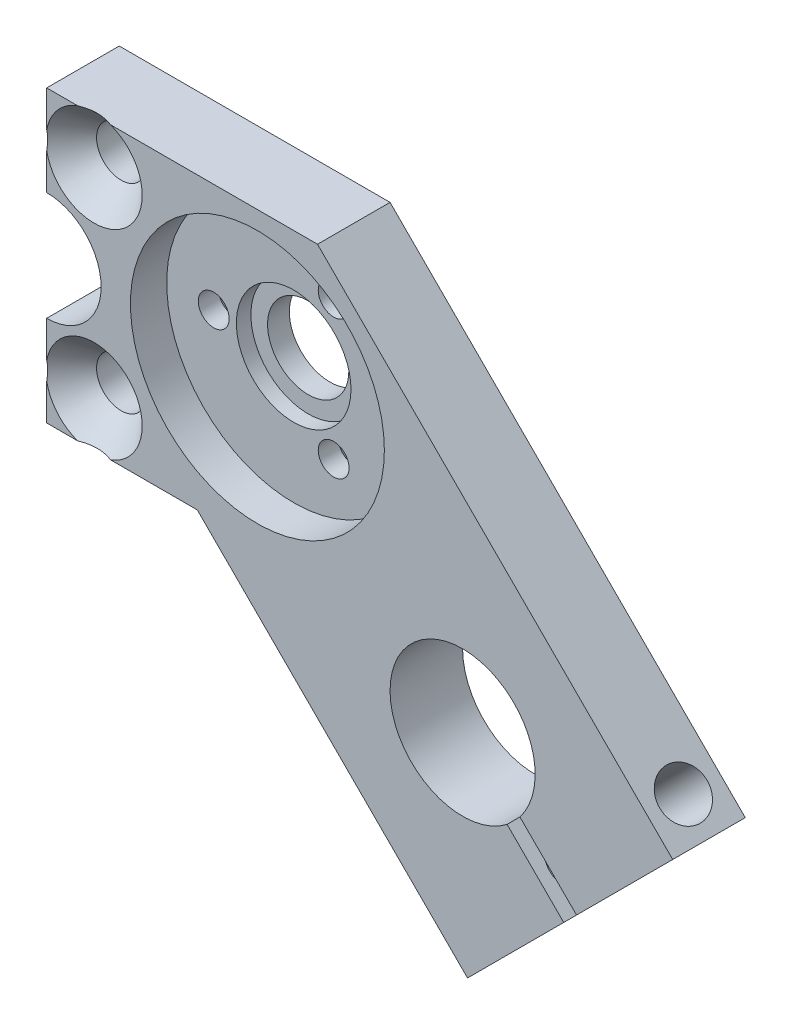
ISO-10303-21;
HEADER;
FILE_DESCRIPTION(('STEP AP214'),'2;1');
FILE_NAME('part.step','',(''),(''),'','','');
FILE_SCHEMA(('AUTOMOTIVE_DESIGN { 1 0 10303 214 1 1 1 1 }'));
ENDSEC;
DATA;
#1=APPLICATION_CONTEXT('core data for automotive mechanical design processes');
#2=APPLICATION_PROTOCOL_DEFINITION('international standard','automotive_design',2000,#1);
#3=PRODUCT_CONTEXT('',#1,'mechanical');
#4=PRODUCT('Part','Part','',(#3));
#5=PRODUCT_RELATED_PRODUCT_CATEGORY('part','',(#4));
#6=PRODUCT_DEFINITION_FORMATION('','',#4);
#7=PRODUCT_DEFINITION_CONTEXT('part definition',#1,'design');
#8=PRODUCT_DEFINITION('design','',#6,#7);
#9=PRODUCT_DEFINITION_SHAPE('','',#8);
#10=(LENGTH_UNIT() NAMED_UNIT(*) SI_UNIT(.MILLI.,.METRE.));
#11=(NAMED_UNIT(*) PLANE_ANGLE_UNIT() SI_UNIT($,.RADIAN.));
#12=(NAMED_UNIT(*) SI_UNIT($,.STERADIAN.) SOLID_ANGLE_UNIT());
#13=UNCERTAINTY_MEASURE_WITH_UNIT(LENGTH_MEASURE(1.E-05),#10,'distance_accuracy_value','');
#14=(GEOMETRIC_REPRESENTATION_CONTEXT(3) GLOBAL_UNCERTAINTY_ASSIGNED_CONTEXT((#13)) GLOBAL_UNIT_ASSIGNED_CONTEXT((#10,
#11,#12)) REPRESENTATION_CONTEXT('',''));
#15=CARTESIAN_POINT('',(0.,0.,0.));
#16=DIRECTION('',(0.,0.,1.));
#17=DIRECTION('',(1.,0.,0.));
#18=AXIS2_PLACEMENT_3D('',#15,#16,#17);
#19=CARTESIAN_POINT('',(0.,0.,6.35));
#20=DIRECTION('',(0.,0.,-1.));
#21=DIRECTION('',(-1.,0.,0.));
#22=AXIS2_PLACEMENT_3D('',#19,#20,#21);
#23=CYLINDRICAL_SURFACE('',#22,3.556);
#24=CARTESIAN_POINT('',(0.,0.,0.));
#25=DIRECTION('',(0.,0.,1.));
#26=DIRECTION('',(1.,0.,0.));
#27=AXIS2_PLACEMENT_3D('',#24,#25,#26);
#28=CIRCLE('',#27,3.556);
#29=CARTESIAN_POINT('',(3.556,0.,0.));
#30=VERTEX_POINT('',#29);
#31=EDGE_CURVE('E182',#30,#30,#28,.T.);
#32=ORIENTED_EDGE('',*,*,#31,.F.);
#33=EDGE_LOOP('',(#32));
#34=FACE_BOUND('',#33,.T.);
#35=CARTESIAN_POINT('',(0.,0.,1.905));
#36=DIRECTION('',(0.,0.,1.));
#37=DIRECTION('',(1.,0.,0.));
#38=AXIS2_PLACEMENT_3D('',#35,#36,#37);
#39=CIRCLE('',#38,3.556);
#40=CARTESIAN_POINT('',(3.556,0.,1.905));
#41=VERTEX_POINT('',#40);
#42=EDGE_CURVE('E388',#41,#41,#39,.T.);
#43=ORIENTED_EDGE('',*,*,#42,.T.);
#44=EDGE_LOOP('',(#43));
#45=FACE_BOUND('',#44,.T.);
#46=ADVANCED_FACE('F34',(#34,#45),#23,.F.);
#47=CARTESIAN_POINT('',(-18.4404,0.,6.35));
#48=DIRECTION('',(0.,0.,1.));
#49=DIRECTION('',(1.,0.,0.));
#50=AXIS2_PLACEMENT_3D('',#47,#48,#49);
#51=PLANE('',#50);
#52=CARTESIAN_POINT('',(-14.3002,8.7376,6.35));
#53=DIRECTION('',(0.,0.,1.));
#54=DIRECTION('',(1.,0.,0.));
#55=AXIS2_PLACEMENT_3D('',#52,#53,#54);
#56=CIRCLE('',#55,4.2164);
#57=CARTESIAN_POINT('',(-15.7415241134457,12.7,6.35));
#58=VERTEX_POINT('',#57);
#59=CARTESIAN_POINT('',(-18.4404,9.53558052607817,6.35));
#60=VERTEX_POINT('',#59);
#61=EDGE_CURVE('E51',#58,#60,#56,.T.);
#62=ORIENTED_EDGE('',*,*,#61,.F.);
#63=DIRECTION('',(-1.,0.,0.));
#64=VECTOR('',#63,1.);
#65=CARTESIAN_POINT('',(-18.4404,12.7,6.35));
#66=LINE('',#65,#64);
#67=CARTESIAN_POINT('',(-18.4404,12.7,6.35));
#68=VERTEX_POINT('',#67);
#69=EDGE_CURVE('E162',#58,#68,#66,.T.);
#70=ORIENTED_EDGE('',*,*,#69,.T.);
#71=DIRECTION('',(0.,-1.,0.));
#72=VECTOR('',#71,1.);
#73=CARTESIAN_POINT('',(-18.4404,12.7,6.35));
#74=LINE('',#73,#72);
#75=EDGE_CURVE('E171',#68,#60,#74,.T.);
#76=ORIENTED_EDGE('',*,*,#75,.T.);
#77=EDGE_LOOP('',(#62,#70,#76));
#78=FACE_BOUND('',#77,.T.);
#79=ADVANCED_FACE('F376',(#78),#51,.T.);
#80=CARTESIAN_POINT('',(-14.3002,-8.7376,6.35));
#81=DIRECTION('',(0.,0.,1.));
#82=DIRECTION('',(1.,0.,0.));
#83=AXIS2_PLACEMENT_3D('',#80,#81,#82);
#84=CIRCLE('',#83,4.2164);
#85=CARTESIAN_POINT('',(-18.4404,-9.53558052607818,6.35));
#86=VERTEX_POINT('',#85);
#87=CARTESIAN_POINT('',(-15.7415241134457,-12.7,6.35));
#88=VERTEX_POINT('',#87);
#89=EDGE_CURVE('E270',#86,#88,#84,.T.);
#90=ORIENTED_EDGE('',*,*,#89,.F.);
#91=DIRECTION('',(0.,-1.,0.));
#92=VECTOR('',#91,1.);
#93=CARTESIAN_POINT('',(-18.4404,-4.7625,6.35));
#94=LINE('',#93,#92);
#95=CARTESIAN_POINT('',(-18.4404,-12.7,6.35));
#96=VERTEX_POINT('',#95);
#97=EDGE_CURVE('E496',#86,#96,#94,.T.);
#98=ORIENTED_EDGE('',*,*,#97,.T.);
#99=DIRECTION('',(1.,0.,0.));
#100=VECTOR('',#99,1.);
#101=CARTESIAN_POINT('',(-18.4404,-12.7,6.35));
#102=LINE('',#101,#100);
#103=EDGE_CURVE('E493',#96,#88,#102,.T.);
#104=ORIENTED_EDGE('',*,*,#103,.T.);
#105=EDGE_LOOP('',(#90,#98,#104));
#106=FACE_BOUND('',#105,.T.);
#107=ADVANCED_FACE('F381',(#106),#51,.T.);
#108=CARTESIAN_POINT('',(0.,0.,6.35));
#109=DIRECTION('',(0.,0.,1.));
#110=DIRECTION('',(1.,0.,0.));
#111=AXIS2_PLACEMENT_3D('',#108,#109,#110);
#112=CIRCLE('',#111,11.1125);
#113=CARTESIAN_POINT('',(11.1125,0.,6.35));
#114=VERTEX_POINT('',#113);
#115=EDGE_CURVE('E389',#114,#114,#112,.T.);
#116=ORIENTED_EDGE('',*,*,#115,.F.);
#117=EDGE_LOOP('',(#116));
#118=FACE_BOUND('',#117,.T.);
#119=CARTESIAN_POINT('',(-18.4404,7.93961947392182,6.35));
#120=VERTEX_POINT('',#119);
#121=CARTESIAN_POINT('',(-12.8588758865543,12.7,6.35));
#122=VERTEX_POINT('',#121);
#123=EDGE_CURVE('E146',#120,#122,#56,.T.);
#124=ORIENTED_EDGE('',*,*,#123,.F.);
#125=CARTESIAN_POINT('',(-18.4404,4.7625,6.35));
#126=VERTEX_POINT('',#125);
#127=EDGE_CURVE('E169',#120,#126,#74,.T.);
#128=ORIENTED_EDGE('',*,*,#127,.T.);
#129=CARTESIAN_POINT('',(-18.4404,0.,6.35));
#130=DIRECTION('',(0.,0.,-1.));
#131=DIRECTION('',(1.,0.,0.));
#132=AXIS2_PLACEMENT_3D('',#129,#130,#131);
#133=CIRCLE('',#132,4.7625);
#134=CARTESIAN_POINT('',(-18.4404,-4.7625,6.35));
#135=VERTEX_POINT('',#134);
#136=EDGE_CURVE('E204',#126,#135,#133,.T.);
#137=ORIENTED_EDGE('',*,*,#136,.T.);
#138=CARTESIAN_POINT('',(-18.4404,-7.93961947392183,6.35));
#139=VERTEX_POINT('',#138);
#140=EDGE_CURVE('E498',#135,#139,#94,.T.);
#141=ORIENTED_EDGE('',*,*,#140,.T.);
#142=CARTESIAN_POINT('',(-12.8588758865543,-12.7,6.35));
#143=VERTEX_POINT('',#142);
#144=EDGE_CURVE('E58',#143,#139,#84,.T.);
#145=ORIENTED_EDGE('',*,*,#144,.F.);
#146=CARTESIAN_POINT('',(-5.26051224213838,-12.7,6.35));
#147=VERTEX_POINT('',#146);
#148=EDGE_CURVE('E489',#143,#147,#102,.T.);
#149=ORIENTED_EDGE('',*,*,#148,.T.);
#150=DIRECTION('',(0.707106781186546,-0.707106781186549,0.));
#151=VECTOR('',#150,1.);
#152=CARTESIAN_POINT('',(-5.26051224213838,-12.7,6.35));
#153=LINE('',#152,#151);
#154=CARTESIAN_POINT('',(18.3915645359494,-36.3520767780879,6.35));
#155=VERTEX_POINT('',#154);
#156=EDGE_CURVE('E487',#147,#155,#153,.T.);
#157=ORIENTED_EDGE('',*,*,#156,.T.);
#158=DIRECTION('',(0.707106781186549,0.707106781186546,0.));
#159=VECTOR('',#158,1.);
#160=CARTESIAN_POINT('',(18.3915645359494,-36.3520767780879,6.35));
#161=LINE('',#160,#159);
#162=CARTESIAN_POINT('',(26.8105546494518,-27.9330866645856,6.35));
#163=VERTEX_POINT('',#162);
#164=EDGE_CURVE('E481',#155,#163,#161,.T.);
#165=ORIENTED_EDGE('',*,*,#164,.T.);
#166=DIRECTION('',(-0.707106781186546,0.707106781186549,0.));
#167=VECTOR('',#166,1.);
#168=CARTESIAN_POINT('',(26.8105546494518,-27.9330866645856,6.35));
#169=LINE('',#168,#167);
#170=CARTESIAN_POINT('',(21.8541570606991,-22.9766890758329,6.35));
#171=VERTEX_POINT('',#170);
#172=EDGE_CURVE('E478',#163,#171,#169,.T.);
#173=ORIENTED_EDGE('',*,*,#172,.T.);
#174=CARTESIAN_POINT('',(17.9605122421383,-17.9605122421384,6.35));
#175=DIRECTION('',(0.,0.,-1.));
#176=DIRECTION('',(1.,0.,0.));
#177=AXIS2_PLACEMENT_3D('',#174,#175,#176);
#178=CIRCLE('',#177,6.35);
#179=CARTESIAN_POINT('',(22.9766890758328,-21.8541570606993,6.35));
#180=VERTEX_POINT('',#179);
#181=EDGE_CURVE('E475',#171,#180,#178,.T.);
#182=ORIENTED_EDGE('',*,*,#181,.T.);
#183=DIRECTION('',(0.707106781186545,-0.70710678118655,0.));
#184=VECTOR('',#183,1.);
#185=CARTESIAN_POINT('',(22.9766890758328,-21.8541570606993,6.35));
#186=LINE('',#185,#184);
#187=CARTESIAN_POINT('',(27.9330866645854,-26.8105546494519,6.35));
#188=VERTEX_POINT('',#187);
#189=EDGE_CURVE('E468',#180,#188,#186,.T.);
#190=ORIENTED_EDGE('',*,*,#189,.T.);
#191=DIRECTION('',(0.707106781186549,0.707106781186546,0.));
#192=VECTOR('',#191,1.);
#193=CARTESIAN_POINT('',(27.9330866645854,-26.8105546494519,6.35));
#194=LINE('',#193,#192);
#195=CARTESIAN_POINT('',(36.3520767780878,-18.3915645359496,6.35));
#196=VERTEX_POINT('',#195);
#197=EDGE_CURVE('E464',#188,#196,#194,.T.);
#198=ORIENTED_EDGE('',*,*,#197,.T.);
#199=DIRECTION('',(-0.707106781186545,0.70710678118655,0.));
#200=VECTOR('',#199,1.);
#201=CARTESIAN_POINT('',(36.3520767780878,-18.3915645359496,6.35));
#202=LINE('',#201,#200);
#203=CARTESIAN_POINT('',(5.26051224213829,12.7,6.35));
#204=VERTEX_POINT('',#203);
#205=EDGE_CURVE('E167',#196,#204,#202,.T.);
#206=ORIENTED_EDGE('',*,*,#205,.T.);
#207=EDGE_CURVE('E160',#204,#122,#66,.T.);
#208=ORIENTED_EDGE('',*,*,#207,.T.);
#209=EDGE_LOOP('',(#124,#128,#137,#141,#145,#149,#157,#165,#173,#182,#190,#198,#206,#208));
#210=FACE_BOUND('',#209,.T.);
#211=ADVANCED_FACE('F165',(#118,#210),#51,.T.);
#212=CARTESIAN_POINT('',(-18.4404,0.,0.));
#213=DIRECTION('',(0.,0.,1.));
#214=DIRECTION('',(1.,0.,0.));
#215=AXIS2_PLACEMENT_3D('',#212,#213,#214);
#216=PLANE('',#215);
#217=CARTESIAN_POINT('',(3.50019909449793,6.06252266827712,0.));
#218=DIRECTION('',(0.,0.,-1.));
#219=DIRECTION('',(-1.,0.,0.));
#220=AXIS2_PLACEMENT_3D('',#217,#218,#219);
#221=CIRCLE('',#220,2.75);
#222=CARTESIAN_POINT('',(0.750199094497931,6.06252266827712,0.));
#223=VERTEX_POINT('',#222);
#224=EDGE_CURVE('E409',#223,#223,#221,.T.);
#225=ORIENTED_EDGE('',*,*,#224,.F.);
#226=EDGE_LOOP('',(#225));
#227=FACE_BOUND('',#226,.T.);
#228=CARTESIAN_POINT('',(3.50019909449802,-6.06252266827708,0.));
#229=DIRECTION('',(0.,0.,-1.));
#230=DIRECTION('',(-1.,0.,0.));
#231=AXIS2_PLACEMENT_3D('',#228,#229,#230);
#232=CIRCLE('',#231,2.75);
#233=CARTESIAN_POINT('',(0.750199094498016,-6.06252266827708,0.));
#234=VERTEX_POINT('',#233);
#235=EDGE_CURVE('E405',#234,#234,#232,.T.);
#236=ORIENTED_EDGE('',*,*,#235,.F.);
#237=EDGE_LOOP('',(#236));
#238=FACE_BOUND('',#237,.T.);
#239=CARTESIAN_POINT('',(-7.00039818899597,0.,0.));
#240=DIRECTION('',(0.,0.,-1.));
#241=DIRECTION('',(-1.,0.,0.));
#242=AXIS2_PLACEMENT_3D('',#239,#240,#241);
#243=CIRCLE('',#242,2.75);
#244=CARTESIAN_POINT('',(-9.75039818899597,0.,0.));
#245=VERTEX_POINT('',#244);
#246=EDGE_CURVE('E401',#245,#245,#243,.T.);
#247=ORIENTED_EDGE('',*,*,#246,.F.);
#248=EDGE_LOOP('',(#247));
#249=FACE_BOUND('',#248,.T.);
#250=CARTESIAN_POINT('',(-14.3002,8.7376,0.));
#251=DIRECTION('',(0.,0.,1.));
#252=DIRECTION('',(1.,0.,0.));
#253=AXIS2_PLACEMENT_3D('',#250,#251,#252);
#254=CIRCLE('',#253,2.15265);
#255=CARTESIAN_POINT('',(-12.14755,8.7376,0.));
#256=VERTEX_POINT('',#255);
#257=EDGE_CURVE('E431',#256,#256,#254,.T.);
#258=ORIENTED_EDGE('',*,*,#257,.T.);
#259=EDGE_LOOP('',(#258));
#260=FACE_BOUND('',#259,.T.);
#261=CARTESIAN_POINT('',(-14.3002,-8.7376,0.));
#262=DIRECTION('',(0.,0.,1.));
#263=DIRECTION('',(1.,0.,0.));
#264=AXIS2_PLACEMENT_3D('',#261,#262,#263);
#265=CIRCLE('',#264,2.15265);
#266=CARTESIAN_POINT('',(-12.14755,-8.7376,0.));
#267=VERTEX_POINT('',#266);
#268=EDGE_CURVE('E163',#267,#267,#265,.T.);
#269=ORIENTED_EDGE('',*,*,#268,.T.);
#270=EDGE_LOOP('',(#269));
#271=FACE_BOUND('',#270,.T.);
#272=CARTESIAN_POINT('',(-18.4404,0.,0.));
#273=DIRECTION('',(0.,0.,-1.));
#274=DIRECTION('',(1.,0.,0.));
#275=AXIS2_PLACEMENT_3D('',#272,#273,#274);
#276=CIRCLE('',#275,4.7625);
#277=CARTESIAN_POINT('',(-18.4404,4.7625,0.));
#278=VERTEX_POINT('',#277);
#279=CARTESIAN_POINT('',(-18.4404,-4.7625,0.));
#280=VERTEX_POINT('',#279);
#281=EDGE_CURVE('E178',#278,#280,#276,.T.);
#282=ORIENTED_EDGE('',*,*,#281,.F.);
#283=DIRECTION('',(0.,-1.,0.));
#284=VECTOR('',#283,1.);
#285=CARTESIAN_POINT('',(-18.4404,12.7,0.));
#286=LINE('',#285,#284);
#287=CARTESIAN_POINT('',(-18.4404,12.7,0.));
#288=VERTEX_POINT('',#287);
#289=EDGE_CURVE('E202',#288,#278,#286,.T.);
#290=ORIENTED_EDGE('',*,*,#289,.F.);
#291=DIRECTION('',(-1.,0.,0.));
#292=VECTOR('',#291,1.);
#293=CARTESIAN_POINT('',(-18.4404,12.7,0.));
#294=LINE('',#293,#292);
#295=CARTESIAN_POINT('',(5.26051224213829,12.7,0.));
#296=VERTEX_POINT('',#295);
#297=EDGE_CURVE('E200',#296,#288,#294,.T.);
#298=ORIENTED_EDGE('',*,*,#297,.F.);
#299=DIRECTION('',(-0.707106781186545,0.70710678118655,0.));
#300=VECTOR('',#299,1.);
#301=CARTESIAN_POINT('',(36.3520767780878,-18.3915645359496,0.));
#302=LINE('',#301,#300);
#303=CARTESIAN_POINT('',(36.3520767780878,-18.3915645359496,0.));
#304=VERTEX_POINT('',#303);
#305=EDGE_CURVE('E198',#304,#296,#302,.T.);
#306=ORIENTED_EDGE('',*,*,#305,.F.);
#307=DIRECTION('',(0.707106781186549,0.707106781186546,0.));
#308=VECTOR('',#307,1.);
#309=CARTESIAN_POINT('',(27.9330866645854,-26.8105546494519,0.));
#310=LINE('',#309,#308);
#311=CARTESIAN_POINT('',(27.9330866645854,-26.8105546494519,0.));
#312=VERTEX_POINT('',#311);
#313=EDGE_CURVE('E196',#312,#304,#310,.T.);
#314=ORIENTED_EDGE('',*,*,#313,.F.);
#315=DIRECTION('',(0.707106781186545,-0.70710678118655,0.));
#316=VECTOR('',#315,1.);
#317=CARTESIAN_POINT('',(22.9766890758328,-21.8541570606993,0.));
#318=LINE('',#317,#316);
#319=CARTESIAN_POINT('',(22.9766890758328,-21.8541570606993,0.));
#320=VERTEX_POINT('',#319);
#321=EDGE_CURVE('E194',#320,#312,#318,.T.);
#322=ORIENTED_EDGE('',*,*,#321,.F.);
#323=CARTESIAN_POINT('',(17.9605122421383,-17.9605122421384,0.));
#324=DIRECTION('',(0.,0.,-1.));
#325=DIRECTION('',(1.,0.,0.));
#326=AXIS2_PLACEMENT_3D('',#323,#324,#325);
#327=CIRCLE('',#326,6.35);
#328=CARTESIAN_POINT('',(21.8541570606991,-22.9766890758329,0.));
#329=VERTEX_POINT('',#328);
#330=EDGE_CURVE('E192',#329,#320,#327,.T.);
#331=ORIENTED_EDGE('',*,*,#330,.F.);
#332=DIRECTION('',(-0.707106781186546,0.707106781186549,0.));
#333=VECTOR('',#332,1.);
#334=CARTESIAN_POINT('',(26.8105546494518,-27.9330866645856,0.));
#335=LINE('',#334,#333);
#336=CARTESIAN_POINT('',(26.8105546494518,-27.9330866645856,0.));
#337=VERTEX_POINT('',#336);
#338=EDGE_CURVE('E190',#337,#329,#335,.T.);
#339=ORIENTED_EDGE('',*,*,#338,.F.);
#340=DIRECTION('',(0.707106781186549,0.707106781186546,0.));
#341=VECTOR('',#340,1.);
#342=CARTESIAN_POINT('',(18.3915645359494,-36.3520767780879,0.));
#343=LINE('',#342,#341);
#344=CARTESIAN_POINT('',(18.3915645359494,-36.3520767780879,0.));
#345=VERTEX_POINT('',#344);
#346=EDGE_CURVE('E188',#345,#337,#343,.T.);
#347=ORIENTED_EDGE('',*,*,#346,.F.);
#348=DIRECTION('',(0.707106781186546,-0.707106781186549,0.));
#349=VECTOR('',#348,1.);
#350=CARTESIAN_POINT('',(-5.26051224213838,-12.7,0.));
#351=LINE('',#350,#349);
#352=CARTESIAN_POINT('',(-5.26051224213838,-12.7,0.));
#353=VERTEX_POINT('',#352);
#354=EDGE_CURVE('E186',#353,#345,#351,.T.);
#355=ORIENTED_EDGE('',*,*,#354,.F.);
#356=DIRECTION('',(1.,0.,0.));
#357=VECTOR('',#356,1.);
#358=CARTESIAN_POINT('',(-18.4404,-12.7,0.));
#359=LINE('',#358,#357);
#360=CARTESIAN_POINT('',(-18.4404,-12.7,0.));
#361=VERTEX_POINT('',#360);
#362=EDGE_CURVE('E184',#361,#353,#359,.T.);
#363=ORIENTED_EDGE('',*,*,#362,.F.);
#364=DIRECTION('',(0.,-1.,0.));
#365=VECTOR('',#364,1.);
#366=CARTESIAN_POINT('',(-18.4404,-4.7625,0.));
#367=LINE('',#366,#365);
#368=EDGE_CURVE('E181',#280,#361,#367,.T.);
#369=ORIENTED_EDGE('',*,*,#368,.F.);
#370=EDGE_LOOP('',(#282,#290,#298,#306,#314,#322,#331,#339,#347,#355,#363,#369));
#371=FACE_BOUND('',#370,.T.);
#372=ORIENTED_EDGE('',*,*,#31,.T.);
#373=EDGE_LOOP('',(#372));
#374=FACE_BOUND('',#373,.T.);
#375=ADVANCED_FACE('F439',(#227,#238,#249,#260,#271,#371,#374),#216,.F.);
#376=CARTESIAN_POINT('',(-18.4404,0.,6.35));
#377=DIRECTION('',(0.,0.,-1.));
#378=DIRECTION('',(-1.,0.,0.));
#379=AXIS2_PLACEMENT_3D('',#376,#377,#378);
#380=CYLINDRICAL_SURFACE('',#379,4.7625);
#381=ORIENTED_EDGE('',*,*,#281,.T.);
#382=DIRECTION('',(0.,0.,-1.));
#383=VECTOR('',#382,1.);
#384=CARTESIAN_POINT('',(-18.4404,-4.7625,6.35));
#385=LINE('',#384,#383);
#386=EDGE_CURVE('E236',#135,#280,#385,.T.);
#387=ORIENTED_EDGE('',*,*,#386,.F.);
#388=ORIENTED_EDGE('',*,*,#136,.F.);
#389=DIRECTION('',(0.,0.,-1.));
#390=VECTOR('',#389,1.);
#391=CARTESIAN_POINT('',(-18.4404,4.7625,6.35));
#392=LINE('',#391,#390);
#393=EDGE_CURVE('E177',#126,#278,#392,.T.);
#394=ORIENTED_EDGE('',*,*,#393,.T.);
#395=EDGE_LOOP('',(#381,#387,#388,#394));
#396=FACE_BOUND('',#395,.T.);
#397=ADVANCED_FACE('F36',(#396),#380,.F.);
#398=CARTESIAN_POINT('',(-18.4404,-4.7625,6.35));
#399=DIRECTION('',(1.,0.,0.));
#400=DIRECTION('',(0.,0.,-1.));
#401=AXIS2_PLACEMENT_3D('',#398,#399,#400);
#402=PLANE('',#401);
#403=ORIENTED_EDGE('',*,*,#97,.F.);
#404=CARTESIAN_POINT('',(-18.4404,-15.7669139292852,10.8842601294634));
#405=CARTESIAN_POINT('',(-18.4404,-15.6298279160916,10.7483931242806));
#406=CARTESIAN_POINT('',(-18.4404,-15.4922422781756,10.6130264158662));
#407=CARTESIAN_POINT('',(-18.4404,-15.215871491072,10.3435057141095));
#408=CARTESIAN_POINT('',(-18.4404,-15.077086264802,10.2093517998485));
#409=CARTESIAN_POINT('',(-18.4404,-14.7978290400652,9.94219496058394));
#410=CARTESIAN_POINT('',(-18.4404,-14.6573540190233,9.80919519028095));
#411=CARTESIAN_POINT('',(-18.4404,-14.3747709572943,9.54494578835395));
#412=CARTESIAN_POINT('',(-18.4404,-14.2326629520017,9.4136961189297));
#413=CARTESIAN_POINT('',(-18.4404,-13.9399593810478,9.14736625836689));
#414=CARTESIAN_POINT('',(-18.4404,-13.7892730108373,9.0123856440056));
#415=CARTESIAN_POINT('',(-18.4404,-13.4853476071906,8.74533145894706));
#416=CARTESIAN_POINT('',(-18.4404,-13.3321086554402,8.61325779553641));
#417=CARTESIAN_POINT('',(-18.4404,-13.0226564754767,8.35290880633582));
#418=CARTESIAN_POINT('',(-18.4404,-12.8664459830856,8.22463024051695));
#419=CARTESIAN_POINT('',(-18.4404,-12.5502394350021,7.97284441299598));
#420=CARTESIAN_POINT('',(-18.4404,-12.390243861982,7.84933654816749));
#421=CARTESIAN_POINT('',(-18.4404,-12.0633452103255,7.60694750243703));
#422=CARTESIAN_POINT('',(-18.4404,-11.896377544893,7.48815283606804));
#423=CARTESIAN_POINT('',(-18.4404,-11.5563934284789,7.2592266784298));
#424=CARTESIAN_POINT('',(-18.4404,-11.383373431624,7.1491003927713));
#425=CARTESIAN_POINT('',(-18.4404,-11.0321807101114,6.94216111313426));
#426=CARTESIAN_POINT('',(-18.4404,-10.8540915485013,6.84520790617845));
#427=CARTESIAN_POINT('',(-18.4404,-10.4899190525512,6.66789962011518));
#428=CARTESIAN_POINT('',(-18.4404,-10.3038486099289,6.58751890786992));
#429=CARTESIAN_POINT('',(-18.4404,-10.023844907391,6.48592974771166));
#430=CARTESIAN_POINT('',(-18.4404,-9.93310265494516,6.45587882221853));
#431=CARTESIAN_POINT('',(-18.4404,-9.74968587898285,6.40152024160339));
#432=CARTESIAN_POINT('',(-18.4404,-9.65700764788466,6.37722496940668));
#433=CARTESIAN_POINT('',(-18.4404,-9.45782243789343,6.33239791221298));
#434=CARTESIAN_POINT('',(-18.4404,-9.35110503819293,6.31278637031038));
#435=CARTESIAN_POINT('',(-18.4404,-9.13634244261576,6.28280879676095));
#436=CARTESIAN_POINT('',(-18.4404,-9.02829699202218,6.2724445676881));
#437=CARTESIAN_POINT('',(-18.4404,-8.81180896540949,6.26148428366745));
#438=CARTESIAN_POINT('',(-18.4404,-8.70336687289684,6.26087881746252));
#439=CARTESIAN_POINT('',(-18.4404,-8.48687906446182,6.26944370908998));
#440=CARTESIAN_POINT('',(-18.4404,-8.37883333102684,6.27861362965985));
#441=CARTESIAN_POINT('',(-18.4404,-8.16814191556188,6.30573192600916));
#442=CARTESIAN_POINT('',(-18.4404,-8.06544970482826,6.32332482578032));
#443=CARTESIAN_POINT('',(-18.4404,-7.86172620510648,6.36638988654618));
#444=CARTESIAN_POINT('',(-18.4404,-7.76069527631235,6.39186373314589));
#445=CARTESIAN_POINT('',(-18.4404,-7.56052500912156,6.44982916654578));
#446=CARTESIAN_POINT('',(-18.4404,-7.46138868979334,6.48233107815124));
#447=CARTESIAN_POINT('',(-18.4404,-7.26532939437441,6.55338148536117));
#448=CARTESIAN_POINT('',(-18.4404,-7.16840640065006,6.59192993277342));
#449=CARTESIAN_POINT('',(-18.4404,-6.94208034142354,6.68907101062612));
#450=CARTESIAN_POINT('',(-18.4404,-6.81362533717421,6.74986711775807));
#451=CARTESIAN_POINT('',(-18.4404,-6.56057195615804,6.87906179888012));
#452=CARTESIAN_POINT('',(-18.4404,-6.43597543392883,6.94746395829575));
#453=CARTESIAN_POINT('',(-18.4404,-6.19007172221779,7.09041029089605));
#454=CARTESIAN_POINT('',(-18.4404,-6.0687710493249,7.1649656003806));
#455=CARTESIAN_POINT('',(-18.4404,-5.82929150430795,7.31886540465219));
#456=CARTESIAN_POINT('',(-18.4404,-5.71111217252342,7.39820918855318));
#457=CARTESIAN_POINT('',(-18.4404,-5.4756430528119,7.562005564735));
#458=CARTESIAN_POINT('',(-18.4404,-5.358395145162,7.64651810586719));
#459=CARTESIAN_POINT('',(-18.4404,-5.12628981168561,7.8187600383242));
#460=CARTESIAN_POINT('',(-18.4404,-5.01143245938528,7.90648952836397));
#461=CARTESIAN_POINT('',(-18.4404,-4.78390826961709,8.08447736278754));
#462=CARTESIAN_POINT('',(-18.4404,-4.67123911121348,8.17473274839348));
#463=CARTESIAN_POINT('',(-18.4404,-4.44768283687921,8.35740925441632));
#464=CARTESIAN_POINT('',(-18.4404,-4.33679564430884,8.44983028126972));
#465=CARTESIAN_POINT('',(-18.4404,-4.0904948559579,8.65857171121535));
#466=CARTESIAN_POINT('',(-18.4404,-3.95548791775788,8.77537146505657));
#467=CARTESIAN_POINT('',(-18.4404,-3.68745166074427,9.01122142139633));
#468=CARTESIAN_POINT('',(-18.4404,-3.55442241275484,9.13027170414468));
#469=CARTESIAN_POINT('',(-18.4404,-3.15779911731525,9.49020987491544));
#470=CARTESIAN_POINT('',(-18.4404,-2.89670626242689,9.73385355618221));
#471=CARTESIAN_POINT('',(-18.4404,-2.37926962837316,10.2263732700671));
#472=CARTESIAN_POINT('',(-18.4404,-2.12292846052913,10.4752520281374));
#473=CARTESIAN_POINT('',(-18.4404,-1.61392320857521,10.9767498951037));
#474=CARTESIAN_POINT('',(-18.4404,-1.36125923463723,11.2293691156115));
#475=CARTESIAN_POINT('',(-18.4404,-0.858142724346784,11.7380392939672));
#476=CARTESIAN_POINT('',(-18.4404,-0.607697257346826,11.9940972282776));
#477=CARTESIAN_POINT('',(-18.4404,-0.109040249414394,12.5083846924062));
#478=CARTESIAN_POINT('',(-18.4404,0.139171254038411,12.7666142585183));
#479=CARTESIAN_POINT('',(-18.4404,0.633723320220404,13.2846899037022));
#480=CARTESIAN_POINT('',(-18.4404,0.880064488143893,13.5445354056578));
#481=CARTESIAN_POINT('',(-18.4404,1.37129735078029,14.0655935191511));
#482=CARTESIAN_POINT('',(-18.4404,1.61618904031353,14.3268061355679));
#483=CARTESIAN_POINT('',(-18.4404,2.28630796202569,15.0448358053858));
#484=CARTESIAN_POINT('',(-18.4404,2.71032747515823,15.5027797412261));
#485=CARTESIAN_POINT('',(-18.4404,3.55578472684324,16.4211239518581));
#486=CARTESIAN_POINT('',(-18.4404,3.9772222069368,16.8815244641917));
#487=CARTESIAN_POINT('',(-18.4404,4.8162667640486,17.8020828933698));
#488=CARTESIAN_POINT('',(-18.4404,5.23388253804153,18.2622328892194));
#489=CARTESIAN_POINT('',(-18.4404,6.06753249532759,19.1838689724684));
#490=CARTESIAN_POINT('',(-18.4404,6.48356685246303,19.6453549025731));
#491=CARTESIAN_POINT('',(-18.4404,6.89904433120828,20.1073388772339));
#492=B_SPLINE_CURVE_WITH_KNOTS('',3,(#404,#405,#406,#407,#408,#409,#410,#411,#412,#413,#414,
#415,#416,#417,#418,#419,#420,#421,#422,#423,#424,#425,#426,#427,#428,#429,#430,#431,#432,#433,
#434,#435,#436,#437,#438,#439,#440,#441,#442,#443,#444,#445,#446,#447,#448,#449,#450,#451,#452,
#453,#454,#455,#456,#457,#458,#459,#460,#461,#462,#463,#464,#465,#466,#467,#468,#469,#470,#471,
#472,#473,#474,#475,#476,#477,#478,#479,#480,#481,#482,#483,#484,#485,#486,#487,#488,#489,#490,
#491),.UNSPECIFIED.,.F.,.F.,(4,2,2,2,2,2,2,2,2,2,2,2,2,2,2,2,2,2,2,2,2,2,2,2,2,2,2,2,2,2,2,2,2,
2,2,2,2,2,2,2,2,2,2,4),(0.,0.579029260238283,1.15809600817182,1.7384277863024,2.31874700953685,
2.92562359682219,3.53248080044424,4.13880400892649,4.74505031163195,5.35959823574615,
5.97451244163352,6.58225947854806,7.18905932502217,7.47566680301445,7.76288541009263,
8.0880208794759,8.41321971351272,8.73810491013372,9.06297557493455,9.3752047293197,
9.68750071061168,10.0002586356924,10.313014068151,10.7390257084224,11.1652390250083,
11.592241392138,12.0191805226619,12.4527090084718,12.8862508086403,13.3193044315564,
13.7523393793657,14.2878642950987,14.8234083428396,15.8946416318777,16.9664471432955,
18.038284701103,19.1127900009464,20.1873132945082,21.2614726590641,22.3356358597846,
24.2079304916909,26.0804095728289,27.9446129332,29.8086050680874),.UNSPECIFIED.);
#493=EDGE_CURVE('E43',#86,#139,#492,.T.);
#494=ORIENTED_EDGE('',*,*,#493,.T.);
#495=ORIENTED_EDGE('',*,*,#140,.F.);
#496=ORIENTED_EDGE('',*,*,#386,.T.);
#497=ORIENTED_EDGE('',*,*,#368,.T.);
#498=DIRECTION('',(0.,0.,-1.));
#499=VECTOR('',#498,1.);
#500=CARTESIAN_POINT('',(-18.4404,-12.7,6.35));
#501=LINE('',#500,#499);
#502=EDGE_CURVE('E233',#96,#361,#501,.T.);
#503=ORIENTED_EDGE('',*,*,#502,.F.);
#504=EDGE_LOOP('',(#403,#494,#495,#496,#497,#503));
#505=FACE_BOUND('',#504,.T.);
#506=ADVANCED_FACE('F249',(#505),#402,.F.);
#507=CARTESIAN_POINT('',(-18.4404,-12.7,6.35));
#508=DIRECTION('',(0.,1.,0.));
#509=DIRECTION('',(-1.,0.,0.));
#510=AXIS2_PLACEMENT_3D('',#507,#508,#509);
#511=PLANE('',#510);
#512=ORIENTED_EDGE('',*,*,#148,.F.);
#513=CARTESIAN_POINT('',(-21.6265654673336,-12.7,11.0812815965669));
#514=CARTESIAN_POINT('',(-21.4801208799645,-12.7,10.933116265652));
#515=CARTESIAN_POINT('',(-21.33318725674,-12.7,10.7854307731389));
#516=CARTESIAN_POINT('',(-21.0381316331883,-12.7,10.4912344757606));
#517=CARTESIAN_POINT('',(-20.8900095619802,-12.7,10.3447237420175));
#518=CARTESIAN_POINT('',(-20.5920557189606,-12.7,10.0527879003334));
#519=CARTESIAN_POINT('',(-20.4422208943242,-12.7,9.90736590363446));
#520=CARTESIAN_POINT('',(-20.1409015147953,-12.7,9.61824557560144));
#521=CARTESIAN_POINT('',(-19.9894169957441,-12.7,9.47454720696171));
#522=CARTESIAN_POINT('',(-19.6768235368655,-12.7,9.18211891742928));
#523=CARTESIAN_POINT('',(-19.515612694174,-12.7,9.033497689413));
#524=CARTESIAN_POINT('',(-19.1905170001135,-12.7,8.73921117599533));
#525=CARTESIAN_POINT('',(-19.026632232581,-12.7,8.59354579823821));
#526=CARTESIAN_POINT('',(-18.6956968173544,-12.7,8.30615519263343));
#527=CARTESIAN_POINT('',(-18.5286492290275,-12.7,8.16442645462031));
#528=CARTESIAN_POINT('',(-18.1904285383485,-12.7,7.88599880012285));
#529=CARTESIAN_POINT('',(-18.0192560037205,-12.7,7.74929919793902));
#530=CARTESIAN_POINT('',(-17.6778674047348,-12.7,7.48743232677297));
#531=CARTESIAN_POINT('',(-17.5078345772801,-12.7,7.36202769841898));
#532=CARTESIAN_POINT('',(-17.1615193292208,-12.7,7.11979646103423));
#533=CARTESIAN_POINT('',(-16.9852327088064,-12.7,7.00297578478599));
#534=CARTESIAN_POINT('',(-16.6272767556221,-12.7,6.78292999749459));
#535=CARTESIAN_POINT('',(-16.445700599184,-12.7,6.67955500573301));
#536=CARTESIAN_POINT('',(-16.0738871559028,-12.7,6.48997374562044));
#537=CARTESIAN_POINT('',(-15.8836654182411,-12.7,6.40373804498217));
#538=CARTESIAN_POINT('',(-15.6072485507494,-12.7,6.29857757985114));
#539=CARTESIAN_POINT('',(-15.5248330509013,-12.7,6.26965712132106));
#540=CARTESIAN_POINT('',(-15.358255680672,-12.7,6.21661236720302));
#541=CARTESIAN_POINT('',(-15.2740903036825,-12.7,6.19249898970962));
#542=CARTESIAN_POINT('',(-15.0881371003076,-12.7,6.14567110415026));
#543=CARTESIAN_POINT('',(-14.9860553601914,-12.7,6.12410458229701));
#544=CARTESIAN_POINT('',(-14.7803985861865,-12.7,6.08966591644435));
#545=CARTESIAN_POINT('',(-14.6768232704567,-12.7,6.07679543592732));
#546=CARTESIAN_POINT('',(-14.4690518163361,-12.7,6.06038765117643));
#547=CARTESIAN_POINT('',(-14.3648565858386,-12.7,6.05683901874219));
#548=CARTESIAN_POINT('',(-14.1565825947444,-12.7,6.05922634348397));
#549=CARTESIAN_POINT('',(-14.0525038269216,-12.7,6.06516167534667));
#550=CARTESIAN_POINT('',(-13.8487704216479,-12.7,6.08585714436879));
#551=CARTESIAN_POINT('',(-13.7490844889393,-12.7,6.1003145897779));
#552=CARTESIAN_POINT('',(-13.5511867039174,-12.7,6.13716864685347));
#553=CARTESIAN_POINT('',(-13.4529751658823,-12.7,6.15956692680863));
#554=CARTESIAN_POINT('',(-13.2583035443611,-12.7,6.21149012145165));
#555=CARTESIAN_POINT('',(-13.1618465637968,-12.7,6.24102654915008));
#556=CARTESIAN_POINT('',(-12.9710630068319,-12.7,6.30627133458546));
#557=CARTESIAN_POINT('',(-12.8767364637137,-12.7,6.34197978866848));
#558=CARTESIAN_POINT('',(-12.6654878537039,-12.7,6.42885067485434));
#559=CARTESIAN_POINT('',(-12.5492201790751,-12.7,6.4815984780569));
#560=CARTESIAN_POINT('',(-12.3200065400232,-12.7,6.59391620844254));
#561=CARTESIAN_POINT('',(-12.2070620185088,-12.7,6.65348904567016));
#562=CARTESIAN_POINT('',(-11.9840766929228,-12.7,6.77820276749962));
#563=CARTESIAN_POINT('',(-11.874040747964,-12.7,6.84335228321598));
#564=CARTESIAN_POINT('',(-11.6567098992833,-12.7,6.97807953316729));
#565=CARTESIAN_POINT('',(-11.5494153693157,-12.7,7.0476578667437));
#566=CARTESIAN_POINT('',(-11.3356514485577,-12.7,7.19147349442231));
#567=CARTESIAN_POINT('',(-11.2292187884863,-12.7,7.2657651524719));
#568=CARTESIAN_POINT('',(-11.0185257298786,-12.7,7.41736240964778));
#569=CARTESIAN_POINT('',(-10.9142653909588,-12.7,7.49466809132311));
#570=CARTESIAN_POINT('',(-10.7077418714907,-12.7,7.6516776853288));
#571=CARTESIAN_POINT('',(-10.6054767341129,-12.7,7.7313790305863));
#572=CARTESIAN_POINT('',(-10.4025956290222,-12.7,7.89283958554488));
#573=CARTESIAN_POINT('',(-10.3019795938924,-12.7,7.97459871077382));
#574=CARTESIAN_POINT('',(-9.96967070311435,-12.7,8.24940397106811));
#575=CARTESIAN_POINT('',(-9.74110985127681,-12.7,8.44623894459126));
#576=CARTESIAN_POINT('',(-9.28961844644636,-12.7,8.84628248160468));
#577=CARTESIAN_POINT('',(-9.06668892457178,-12.7,9.04949219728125));
#578=CARTESIAN_POINT('',(-8.62497854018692,-12.7,9.46059367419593));
#579=CARTESIAN_POINT('',(-8.40619995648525,-12.7,9.66848787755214));
#580=CARTESIAN_POINT('',(-7.97191878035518,-12.7,10.0876726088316));
#581=CARTESIAN_POINT('',(-7.75641629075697,-12.7,10.2989632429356));
#582=CARTESIAN_POINT('',(-7.32743593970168,-12.7,10.7246703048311));
#583=CARTESIAN_POINT('',(-7.1139646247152,-12.7,10.9390933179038));
#584=CARTESIAN_POINT('',(-6.6890798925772,-12.7,11.369971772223));
#585=CARTESIAN_POINT('',(-6.47766650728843,-12.7,11.5864272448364));
#586=CARTESIAN_POINT('',(-5.84604306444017,-12.7,12.2380430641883));
#587=CARTESIAN_POINT('',(-5.42830453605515,-12.7,12.6755981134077));
#588=CARTESIAN_POINT('',(-4.64834104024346,-12.7,13.5008999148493));
#589=CARTESIAN_POINT('',(-4.28560088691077,-12.7,13.8881618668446));
#590=CARTESIAN_POINT('',(-3.56264423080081,-12.7,14.6651033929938));
#591=CARTESIAN_POINT('',(-3.20242797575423,-12.7,15.054783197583));
#592=CARTESIAN_POINT('',(-2.48561682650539,-12.7,15.8340864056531));
#593=CARTESIAN_POINT('',(-2.12901287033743,-12.7,16.2237014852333));
#594=CARTESIAN_POINT('',(-1.41736210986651,-12.6999999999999,17.0042692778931));
#595=CARTESIAN_POINT('',(-1.06231513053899,-12.6999999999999,17.3952218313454));
#596=CARTESIAN_POINT('',(-0.707825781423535,-12.6999999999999,17.7866767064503));
#597=B_SPLINE_CURVE_WITH_KNOTS('',3,(#513,#514,#515,#516,#517,#518,#519,#520,#521,#522,#523,
#524,#525,#526,#527,#528,#529,#530,#531,#532,#533,#534,#535,#536,#537,#538,#539,#540,#541,#542,
#543,#544,#545,#546,#547,#548,#549,#550,#551,#552,#553,#554,#555,#556,#557,#558,#559,#560,#561,
#562,#563,#564,#565,#566,#567,#568,#569,#570,#571,#572,#573,#574,#575,#576,#577,#578,#579,#580,
#581,#582,#583,#584,#585,#586,#587,#588,#589,#590,#591,#592,#593,#594,#595,#596),.UNSPECIFIED.,
.F.,.F.,(4,2,2,2,2,2,2,2,2,2,2,2,2,2,2,2,2,2,2,2,2,2,2,2,2,2,2,2,2,2,2,2,2,2,2,2,2,2,2,2,2,4),
(0.,0.624975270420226,1.24998809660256,1.87638091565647,2.50276015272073,3.16052696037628,
3.81827318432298,4.47541275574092,5.13246239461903,5.76610059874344,6.40017269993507,
7.02642624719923,7.65159489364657,7.91349969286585,8.17599273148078,8.48864969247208,
8.80136644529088,9.11370299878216,9.42601895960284,9.72785879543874,10.0297620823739,
10.3321555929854,10.6345538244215,11.0172871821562,11.4001843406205,11.7836852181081,
12.1672381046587,12.5565643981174,12.945901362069,13.3348350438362,13.7237527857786,
14.6284588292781,15.5333293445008,16.438683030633,17.3440650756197,18.2517507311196,
19.1594504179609,20.9742336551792,22.566067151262,24.1580547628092,25.7425684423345,
27.3268991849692),.UNSPECIFIED.);
#598=EDGE_CURVE('E263',#143,#88,#597,.F.);
#599=ORIENTED_EDGE('',*,*,#598,.T.);
#600=ORIENTED_EDGE('',*,*,#103,.F.);
#601=ORIENTED_EDGE('',*,*,#502,.T.);
#602=ORIENTED_EDGE('',*,*,#362,.T.);
#603=DIRECTION('',(0.,0.,-1.));
#604=VECTOR('',#603,1.);
#605=CARTESIAN_POINT('',(-5.26051224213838,-12.7,6.35));
#606=LINE('',#605,#604);
#607=EDGE_CURVE('E230',#147,#353,#606,.T.);
#608=ORIENTED_EDGE('',*,*,#607,.F.);
#609=EDGE_LOOP('',(#512,#599,#600,#601,#602,#608));
#610=FACE_BOUND('',#609,.T.);
#611=ADVANCED_FACE('F273',(#610),#511,.F.);
#612=CARTESIAN_POINT('',(-5.26051224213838,-12.7,6.35));
#613=DIRECTION('',(0.707106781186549,0.707106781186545,0.));
#614=DIRECTION('',(-0.707106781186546,0.70710678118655,0.));
#615=AXIS2_PLACEMENT_3D('',#612,#613,#614);
#616=PLANE('',#615);
#617=CARTESIAN_POINT('',(16.1465005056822,-34.1070127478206,3.175));
#618=DIRECTION('',(-0.70710678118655,-0.707106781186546,0.));
#619=DIRECTION('',(0.707106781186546,-0.70710678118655,0.));
#620=AXIS2_PLACEMENT_3D('',#617,#618,#619);
#621=CIRCLE('',#620,2.15265);
#622=CARTESIAN_POINT('',(17.6686539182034,-35.6291661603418,3.175));
#623=VERTEX_POINT('',#622);
#624=EDGE_CURVE('E731',#623,#623,#621,.T.);
#625=ORIENTED_EDGE('',*,*,#624,.F.);
#626=EDGE_LOOP('',(#625));
#627=FACE_BOUND('',#626,.T.);
#628=ORIENTED_EDGE('',*,*,#354,.T.);
#629=DIRECTION('',(0.,0.,-1.));
#630=VECTOR('',#629,1.);
#631=CARTESIAN_POINT('',(18.3915645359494,-36.3520767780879,6.35));
#632=LINE('',#631,#630);
#633=EDGE_CURVE('E227',#155,#345,#632,.T.);
#634=ORIENTED_EDGE('',*,*,#633,.F.);
#635=ORIENTED_EDGE('',*,*,#156,.F.);
#636=ORIENTED_EDGE('',*,*,#607,.T.);
#637=EDGE_LOOP('',(#628,#634,#635,#636));
#638=FACE_BOUND('',#637,.T.);
#639=ADVANCED_FACE('F277',(#627,#638),#616,.F.);
#640=CARTESIAN_POINT('',(18.3915645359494,-36.3520767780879,6.35));
#641=DIRECTION('',(-0.707106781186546,0.707106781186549,0.));
#642=DIRECTION('',(-0.707106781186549,-0.707106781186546,0.));
#643=AXIS2_PLACEMENT_3D('',#640,#641,#642);
#644=PLANE('',#643);
#645=ORIENTED_EDGE('',*,*,#346,.T.);
#646=DIRECTION('',(0.,0.,-1.));
#647=VECTOR('',#646,1.);
#648=CARTESIAN_POINT('',(26.8105546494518,-27.9330866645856,6.35));
#649=LINE('',#648,#647);
#650=EDGE_CURVE('E224',#163,#337,#649,.T.);
#651=ORIENTED_EDGE('',*,*,#650,.F.);
#652=ORIENTED_EDGE('',*,*,#164,.F.);
#653=ORIENTED_EDGE('',*,*,#633,.T.);
#654=EDGE_LOOP('',(#645,#651,#652,#653));
#655=FACE_BOUND('',#654,.T.);
#656=ADVANCED_FACE('F281',(#655),#644,.F.);
#657=CARTESIAN_POINT('',(26.8105546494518,-27.9330866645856,6.35));
#658=DIRECTION('',(-0.707106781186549,-0.707106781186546,0.));
#659=DIRECTION('',(0.707106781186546,-0.707106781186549,0.));
#660=AXIS2_PLACEMENT_3D('',#657,#658,#659);
#661=PLANE('',#660);
#662=CARTESIAN_POINT('',(24.5654906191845,-25.6880226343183,3.175));
#663=DIRECTION('',(-0.707106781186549,-0.707106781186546,0.));
#664=DIRECTION('',(0.707106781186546,-0.707106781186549,0.));
#665=AXIS2_PLACEMENT_3D('',#662,#663,#664);
#666=CIRCLE('',#665,2.15265);
#667=CARTESIAN_POINT('',(26.0876440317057,-27.2101760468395,3.175));
#668=VERTEX_POINT('',#667);
#669=EDGE_CURVE('E38',#668,#668,#666,.T.);
#670=ORIENTED_EDGE('',*,*,#669,.T.);
#671=EDGE_LOOP('',(#670));
#672=FACE_BOUND('',#671,.T.);
#673=ORIENTED_EDGE('',*,*,#338,.T.);
#674=DIRECTION('',(0.,0.,-1.));
#675=VECTOR('',#674,1.);
#676=CARTESIAN_POINT('',(21.8541570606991,-22.9766890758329,6.35));
#677=LINE('',#676,#675);
#678=EDGE_CURVE('E221',#171,#329,#677,.T.);
#679=ORIENTED_EDGE('',*,*,#678,.F.);
#680=ORIENTED_EDGE('',*,*,#172,.F.);
#681=ORIENTED_EDGE('',*,*,#650,.T.);
#682=EDGE_LOOP('',(#673,#679,#680,#681));
#683=FACE_BOUND('',#682,.T.);
#684=ADVANCED_FACE('F285',(#672,#683),#661,.F.);
#685=CARTESIAN_POINT('',(17.9605122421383,-17.9605122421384,6.35));
#686=DIRECTION('',(0.,0.,-1.));
#687=DIRECTION('',(-1.,0.,0.));
#688=AXIS2_PLACEMENT_3D('',#685,#686,#687);
#689=CYLINDRICAL_SURFACE('',#688,6.35);
#690=ORIENTED_EDGE('',*,*,#330,.T.);
#691=DIRECTION('',(0.,0.,-1.));
#692=VECTOR('',#691,1.);
#693=CARTESIAN_POINT('',(22.9766890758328,-21.8541570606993,6.35));
#694=LINE('',#693,#692);
#695=EDGE_CURVE('E218',#180,#320,#694,.T.);
#696=ORIENTED_EDGE('',*,*,#695,.F.);
#697=ORIENTED_EDGE('',*,*,#181,.F.);
#698=ORIENTED_EDGE('',*,*,#678,.T.);
#699=EDGE_LOOP('',(#690,#696,#697,#698));
#700=FACE_BOUND('',#699,.T.);
#701=ADVANCED_FACE('F289',(#700),#689,.F.);
#702=CARTESIAN_POINT('',(22.9766890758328,-21.8541570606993,6.35));
#703=DIRECTION('',(0.70710678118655,0.707106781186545,0.));
#704=DIRECTION('',(-0.707106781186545,0.70710678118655,0.));
#705=AXIS2_PLACEMENT_3D('',#702,#703,#704);
#706=PLANE('',#705);
#707=CARTESIAN_POINT('',(25.6880226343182,-24.5654906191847,3.175));
#708=DIRECTION('',(0.70710678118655,0.707106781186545,0.));
#709=DIRECTION('',(-0.707106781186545,0.70710678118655,0.));
#710=AXIS2_PLACEMENT_3D('',#707,#708,#709);
#711=CIRCLE('',#710,2.0828);
#712=CARTESIAN_POINT('',(24.2152606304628,-23.0927286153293,3.175));
#713=VERTEX_POINT('',#712);
#714=EDGE_CURVE('E734',#713,#713,#711,.T.);
#715=ORIENTED_EDGE('',*,*,#714,.T.);
#716=EDGE_LOOP('',(#715));
#717=FACE_BOUND('',#716,.T.);
#718=ORIENTED_EDGE('',*,*,#321,.T.);
#719=DIRECTION('',(0.,0.,-1.));
#720=VECTOR('',#719,1.);
#721=CARTESIAN_POINT('',(27.9330866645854,-26.8105546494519,6.35));
#722=LINE('',#721,#720);
#723=EDGE_CURVE('E215',#188,#312,#722,.T.);
#724=ORIENTED_EDGE('',*,*,#723,.F.);
#725=ORIENTED_EDGE('',*,*,#189,.F.);
#726=ORIENTED_EDGE('',*,*,#695,.T.);
#727=EDGE_LOOP('',(#718,#724,#725,#726));
#728=FACE_BOUND('',#727,.T.);
#729=ADVANCED_FACE('F293',(#717,#728),#706,.F.);
#730=CARTESIAN_POINT('',(27.9330866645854,-26.8105546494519,6.35));
#731=DIRECTION('',(-0.707106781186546,0.707106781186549,0.));
#732=DIRECTION('',(-0.707106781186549,-0.707106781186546,0.));
#733=AXIS2_PLACEMENT_3D('',#730,#731,#732);
#734=PLANE('',#733);
#735=ORIENTED_EDGE('',*,*,#313,.T.);
#736=DIRECTION('',(0.,0.,-1.));
#737=VECTOR('',#736,1.);
#738=CARTESIAN_POINT('',(36.3520767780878,-18.3915645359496,6.35));
#739=LINE('',#738,#737);
#740=EDGE_CURVE('E212',#196,#304,#739,.T.);
#741=ORIENTED_EDGE('',*,*,#740,.F.);
#742=ORIENTED_EDGE('',*,*,#197,.F.);
#743=ORIENTED_EDGE('',*,*,#723,.T.);
#744=EDGE_LOOP('',(#735,#741,#742,#743));
#745=FACE_BOUND('',#744,.T.);
#746=ADVANCED_FACE('F297',(#745),#734,.F.);
#747=CARTESIAN_POINT('',(36.3520767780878,-18.3915645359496,6.35));
#748=DIRECTION('',(-0.70710678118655,-0.707106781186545,0.));
#749=DIRECTION('',(0.707106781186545,-0.70710678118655,0.));
#750=AXIS2_PLACEMENT_3D('',#747,#748,#749);
#751=PLANE('',#750);
#752=CARTESIAN_POINT('',(34.1070127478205,-16.1465005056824,3.175));
#753=DIRECTION('',(0.70710678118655,0.707106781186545,0.));
#754=DIRECTION('',(-0.707106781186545,0.70710678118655,0.));
#755=AXIS2_PLACEMENT_3D('',#752,#753,#754);
#756=CIRCLE('',#755,2.0828);
#757=CARTESIAN_POINT('',(32.6342507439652,-14.673738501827,3.175));
#758=VERTEX_POINT('',#757);
#759=EDGE_CURVE('E737',#758,#758,#756,.T.);
#760=ORIENTED_EDGE('',*,*,#759,.F.);
#761=EDGE_LOOP('',(#760));
#762=FACE_BOUND('',#761,.T.);
#763=ORIENTED_EDGE('',*,*,#305,.T.);
#764=DIRECTION('',(0.,0.,-1.));
#765=VECTOR('',#764,1.);
#766=CARTESIAN_POINT('',(5.26051224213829,12.7,6.35));
#767=LINE('',#766,#765);
#768=EDGE_CURVE('E210',#204,#296,#767,.T.);
#769=ORIENTED_EDGE('',*,*,#768,.F.);
#770=ORIENTED_EDGE('',*,*,#205,.F.);
#771=ORIENTED_EDGE('',*,*,#740,.T.);
#772=EDGE_LOOP('',(#763,#769,#770,#771));
#773=FACE_BOUND('',#772,.T.);
#774=ADVANCED_FACE('F301',(#762,#773),#751,.F.);
#775=CARTESIAN_POINT('',(-18.4404,12.7,6.35));
#776=DIRECTION('',(0.,-1.,0.));
#777=DIRECTION('',(1.,0.,0.));
#778=AXIS2_PLACEMENT_3D('',#775,#776,#777);
#779=PLANE('',#778);
#780=ORIENTED_EDGE('',*,*,#69,.F.);
#781=CARTESIAN_POINT('',(-21.6265654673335,12.7,11.0812815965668));
#782=CARTESIAN_POINT('',(-21.4801208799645,12.7,10.9331162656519));
#783=CARTESIAN_POINT('',(-21.33318725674,12.7,10.7854307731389));
#784=CARTESIAN_POINT('',(-21.0381316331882,12.7,10.4912344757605));
#785=CARTESIAN_POINT('',(-20.8900095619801,12.7,10.3447237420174));
#786=CARTESIAN_POINT('',(-20.5920557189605,12.7,10.0527879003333));
#787=CARTESIAN_POINT('',(-20.4422208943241,12.7,9.9073659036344));
#788=CARTESIAN_POINT('',(-20.1409015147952,12.7,9.61824557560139));
#789=CARTESIAN_POINT('',(-19.989416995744,12.7,9.47454720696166));
#790=CARTESIAN_POINT('',(-19.6768235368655,12.7,9.18211891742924));
#791=CARTESIAN_POINT('',(-19.515612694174,12.7,9.03349768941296));
#792=CARTESIAN_POINT('',(-19.1905170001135,12.7,8.7392111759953));
#793=CARTESIAN_POINT('',(-19.026632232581,12.7,8.59354579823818));
#794=CARTESIAN_POINT('',(-18.6956968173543,12.7,8.30615519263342));
#795=CARTESIAN_POINT('',(-18.5286492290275,12.7,8.1644264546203));
#796=CARTESIAN_POINT('',(-18.1904285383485,12.7,7.88599880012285));
#797=CARTESIAN_POINT('',(-18.0192560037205,12.7,7.74929919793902));
#798=CARTESIAN_POINT('',(-17.6778674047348,12.7,7.48743232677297));
#799=CARTESIAN_POINT('',(-17.5078345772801,12.7,7.36202769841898));
#800=CARTESIAN_POINT('',(-17.1615193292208,12.7,7.11979646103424));
#801=CARTESIAN_POINT('',(-16.9852327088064,12.7,7.002975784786));
#802=CARTESIAN_POINT('',(-16.6272767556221,12.7,6.7829299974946));
#803=CARTESIAN_POINT('',(-16.445700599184,12.7,6.67955500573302));
#804=CARTESIAN_POINT('',(-16.0738871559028,12.7,6.48997374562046));
#805=CARTESIAN_POINT('',(-15.8836654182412,12.7,6.40373804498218));
#806=CARTESIAN_POINT('',(-15.6072485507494,12.7,6.29857757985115));
#807=CARTESIAN_POINT('',(-15.5248330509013,12.7,6.26965712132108));
#808=CARTESIAN_POINT('',(-15.358255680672,12.7,6.21661236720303));
#809=CARTESIAN_POINT('',(-15.2740903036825,12.7,6.19249898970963));
#810=CARTESIAN_POINT('',(-15.0881371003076,12.7,6.14567110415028));
#811=CARTESIAN_POINT('',(-14.9860553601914,12.7,6.12410458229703));
#812=CARTESIAN_POINT('',(-14.7803985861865,12.7,6.08966591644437));
#813=CARTESIAN_POINT('',(-14.6768232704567,12.7,6.07679543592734));
#814=CARTESIAN_POINT('',(-14.4690518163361,12.7,6.06038765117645));
#815=CARTESIAN_POINT('',(-14.3648565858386,12.7,6.05683901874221));
#816=CARTESIAN_POINT('',(-14.1565825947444,12.7,6.059226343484));
#817=CARTESIAN_POINT('',(-14.0525038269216,12.7,6.06516167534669));
#818=CARTESIAN_POINT('',(-13.8487704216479,12.7,6.08585714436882));
#819=CARTESIAN_POINT('',(-13.7490844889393,12.7,6.10031458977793));
#820=CARTESIAN_POINT('',(-13.5511867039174,12.7,6.1371686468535));
#821=CARTESIAN_POINT('',(-13.4529751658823,12.7,6.15956692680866));
#822=CARTESIAN_POINT('',(-13.2583035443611,12.7,6.21149012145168));
#823=CARTESIAN_POINT('',(-13.1618465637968,12.7,6.24102654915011));
#824=CARTESIAN_POINT('',(-12.9710630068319,12.7,6.30627133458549));
#825=CARTESIAN_POINT('',(-12.8767364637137,12.7,6.34197978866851));
#826=CARTESIAN_POINT('',(-12.6654878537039,12.7,6.42885067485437));
#827=CARTESIAN_POINT('',(-12.5492201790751,12.7,6.48159847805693));
#828=CARTESIAN_POINT('',(-12.3200065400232,12.7,6.59391620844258));
#829=CARTESIAN_POINT('',(-12.2070620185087,12.7,6.6534890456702));
#830=CARTESIAN_POINT('',(-11.9840766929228,12.7,6.77820276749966));
#831=CARTESIAN_POINT('',(-11.8740407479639,12.7,6.84335228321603));
#832=CARTESIAN_POINT('',(-11.6567098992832,12.7,6.97807953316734));
#833=CARTESIAN_POINT('',(-11.5494153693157,12.7,7.04765786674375));
#834=CARTESIAN_POINT('',(-11.3356514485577,12.7,7.19147349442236));
#835=CARTESIAN_POINT('',(-11.2292187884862,12.7,7.26576515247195));
#836=CARTESIAN_POINT('',(-11.0185257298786,12.7,7.41736240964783));
#837=CARTESIAN_POINT('',(-10.9142653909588,12.7,7.49466809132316));
#838=CARTESIAN_POINT('',(-10.7077418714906,12.7,7.65167768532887));
#839=CARTESIAN_POINT('',(-10.6054767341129,12.7,7.73137903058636));
#840=CARTESIAN_POINT('',(-10.4025956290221,12.7,7.89283958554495));
#841=CARTESIAN_POINT('',(-10.3019795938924,12.7,7.97459871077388));
#842=CARTESIAN_POINT('',(-9.9696707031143,12.7,8.24940397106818));
#843=CARTESIAN_POINT('',(-9.74110985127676,12.7,8.44623894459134));
#844=CARTESIAN_POINT('',(-9.2896184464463,12.7,8.84628248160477));
#845=CARTESIAN_POINT('',(-9.06668892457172,12.7,9.04949219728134));
#846=CARTESIAN_POINT('',(-8.62497854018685,12.7,9.46059367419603));
#847=CARTESIAN_POINT('',(-8.40619995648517,12.7,9.66848787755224));
#848=CARTESIAN_POINT('',(-7.97191878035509,12.7,10.0876726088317));
#849=CARTESIAN_POINT('',(-7.75641629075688,12.7,10.2989632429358));
#850=CARTESIAN_POINT('',(-7.32743593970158,12.7,10.7246703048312));
#851=CARTESIAN_POINT('',(-7.1139646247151,12.7,10.939093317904));
#852=CARTESIAN_POINT('',(-6.68907989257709,12.7,11.3699717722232));
#853=CARTESIAN_POINT('',(-6.47766650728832,12.7,11.5864272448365));
#854=CARTESIAN_POINT('',(-5.84604306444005,12.7,12.2380430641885));
#855=CARTESIAN_POINT('',(-5.42830453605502,12.7,12.6755981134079));
#856=CARTESIAN_POINT('',(-4.64834104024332,12.7,13.5008999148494));
#857=CARTESIAN_POINT('',(-4.28560088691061,12.7,13.8881618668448));
#858=CARTESIAN_POINT('',(-3.56264423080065,12.7,14.665103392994));
#859=CARTESIAN_POINT('',(-3.20242797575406,12.7,15.0547831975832));
#860=CARTESIAN_POINT('',(-2.4856168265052,12.7,15.8340864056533));
#861=CARTESIAN_POINT('',(-2.12901287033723,12.7,16.2237014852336));
#862=CARTESIAN_POINT('',(-1.4173621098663,12.7,17.0042692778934));
#863=CARTESIAN_POINT('',(-1.06231513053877,12.7,17.3952218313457));
#864=CARTESIAN_POINT('',(-0.707825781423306,12.7,17.7866767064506));
#865=B_SPLINE_CURVE_WITH_KNOTS('',3,(#781,#782,#783,#784,#785,#786,#787,#788,#789,#790,#791,
#792,#793,#794,#795,#796,#797,#798,#799,#800,#801,#802,#803,#804,#805,#806,#807,#808,#809,#810,
#811,#812,#813,#814,#815,#816,#817,#818,#819,#820,#821,#822,#823,#824,#825,#826,#827,#828,#829,
#830,#831,#832,#833,#834,#835,#836,#837,#838,#839,#840,#841,#842,#843,#844,#845,#846,#847,#848,
#849,#850,#851,#852,#853,#854,#855,#856,#857,#858,#859,#860,#861,#862,#863,#864),.UNSPECIFIED.,
.F.,.F.,(4,2,2,2,2,2,2,2,2,2,2,2,2,2,2,2,2,2,2,2,2,2,2,2,2,2,2,2,2,2,2,2,2,2,2,2,2,2,2,2,2,4),
(0.,0.624975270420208,1.24998809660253,1.87638091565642,2.50276015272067,3.16052696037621,
3.81827318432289,4.47541275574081,5.13246239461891,5.76610059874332,6.40017269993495,
7.0264262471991,7.65159489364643,7.91349969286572,8.17599273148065,8.48864969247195,
8.80136644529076,9.11370299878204,9.42601895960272,9.72785879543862,10.0297620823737,
10.3321555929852,10.6345538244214,11.0172871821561,11.4001843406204,11.783685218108,
12.1672381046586,12.5565643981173,12.9459013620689,13.3348350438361,13.7237527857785,
14.628458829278,15.5333293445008,16.438683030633,17.3440650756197,18.2517507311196,
19.1594504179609,20.9742336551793,22.5660671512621,24.1580547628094,25.7425684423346,
27.3268991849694),.UNSPECIFIED.);
#866=EDGE_CURVE('E149',#58,#122,#865,.T.);
#867=ORIENTED_EDGE('',*,*,#866,.T.);
#868=ORIENTED_EDGE('',*,*,#207,.F.);
#869=ORIENTED_EDGE('',*,*,#768,.T.);
#870=ORIENTED_EDGE('',*,*,#297,.T.);
#871=DIRECTION('',(0.,0.,-1.));
#872=VECTOR('',#871,1.);
#873=CARTESIAN_POINT('',(-18.4404,12.7,6.35));
#874=LINE('',#873,#872);
#875=EDGE_CURVE('E207',#68,#288,#874,.T.);
#876=ORIENTED_EDGE('',*,*,#875,.F.);
#877=EDGE_LOOP('',(#780,#867,#868,#869,#870,#876));
#878=FACE_BOUND('',#877,.T.);
#879=ADVANCED_FACE('F158',(#878),#779,.F.);
#880=CARTESIAN_POINT('',(-18.4404,12.7,6.35));
#881=DIRECTION('',(1.,0.,0.));
#882=DIRECTION('',(0.,0.,-1.));
#883=AXIS2_PLACEMENT_3D('',#880,#881,#882);
#884=PLANE('',#883);
#885=ORIENTED_EDGE('',*,*,#127,.F.);
#886=CARTESIAN_POINT('',(-18.4404,1.64972252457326,10.9423710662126));
#887=CARTESIAN_POINT('',(-18.4404,1.78826454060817,10.80476908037));
#888=CARTESIAN_POINT('',(-18.4404,1.92730733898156,10.6676675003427));
#889=CARTESIAN_POINT('',(-18.4404,2.20659660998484,10.3946784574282));
#890=CARTESIAN_POINT('',(-18.4404,2.34684315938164,10.2587910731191));
#891=CARTESIAN_POINT('',(-18.4404,2.62903241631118,9.98816596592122));
#892=CARTESIAN_POINT('',(-18.4404,2.77097816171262,9.85343140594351));
#893=CARTESIAN_POINT('',(-18.4404,3.05651142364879,9.58571721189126));
#894=CARTESIAN_POINT('',(-18.4404,3.20009890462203,9.45273753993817));
#895=CARTESIAN_POINT('',(-18.4404,3.49589914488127,9.18282448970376));
#896=CARTESIAN_POINT('',(-18.4404,3.64820410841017,9.04599193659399));
#897=CARTESIAN_POINT('',(-18.4404,3.95538917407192,8.77525055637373));
#898=CARTESIAN_POINT('',(-18.4404,4.11026919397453,8.64134163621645));
#899=CARTESIAN_POINT('',(-18.4404,4.4230343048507,8.3773510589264));
#900=CARTESIAN_POINT('',(-18.4404,4.58091661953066,8.2472661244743));
#901=CARTESIAN_POINT('',(-18.4404,4.90051446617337,7.99191120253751));
#902=CARTESIAN_POINT('',(-18.4404,5.06222950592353,7.86664060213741));
#903=CARTESIAN_POINT('',(-18.4404,5.39187708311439,7.62135805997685));
#904=CARTESIAN_POINT('',(-18.4404,5.5598521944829,7.50140294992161));
#905=CARTESIAN_POINT('',(-18.4404,5.90189667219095,7.27018327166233));
#906=CARTESIAN_POINT('',(-18.4404,6.07596965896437,7.15892399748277));
#907=CARTESIAN_POINT('',(-18.4404,6.42931352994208,6.94980047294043));
#908=CARTESIAN_POINT('',(-18.4404,6.60849960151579,6.85179453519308));
#909=CARTESIAN_POINT('',(-18.4404,6.97496436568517,6.67250369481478));
#910=CARTESIAN_POINT('',(-18.4404,7.16222987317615,6.59119270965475));
#911=CARTESIAN_POINT('',(-18.4404,7.44312124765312,6.48875777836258));
#912=CARTESIAN_POINT('',(-18.4404,7.53348725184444,6.45864613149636));
#913=CARTESIAN_POINT('',(-18.4404,7.71614539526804,6.40410105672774));
#914=CARTESIAN_POINT('',(-18.4404,7.80844125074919,6.37967994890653));
#915=CARTESIAN_POINT('',(-18.4404,8.00723201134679,6.33441419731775));
#916=CARTESIAN_POINT('',(-18.4404,8.11394518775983,6.31451296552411));
#917=CARTESIAN_POINT('',(-18.4404,8.32872291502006,6.28394162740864));
#918=CARTESIAN_POINT('',(-18.4404,8.43678772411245,6.27327331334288));
#919=CARTESIAN_POINT('',(-18.4404,8.65333893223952,6.26170510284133));
#920=CARTESIAN_POINT('',(-18.4404,8.76182480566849,6.26079551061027));
#921=CARTESIAN_POINT('',(-18.4404,8.97842677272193,6.2687670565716));
#922=CARTESIAN_POINT('',(-18.4404,9.08654288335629,6.27764773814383));
#923=CARTESIAN_POINT('',(-18.4404,9.29743446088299,6.3042313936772));
#924=CARTESIAN_POINT('',(-18.4404,9.40025519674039,6.32158125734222));
#925=CARTESIAN_POINT('',(-18.4404,9.60424715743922,6.36419882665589));
#926=CARTESIAN_POINT('',(-18.4404,9.70541802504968,6.38946822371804));
#927=CARTESIAN_POINT('',(-18.4404,9.90587445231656,6.44706456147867));
#928=CARTESIAN_POINT('',(-18.4404,10.0051569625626,6.47940201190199));
#929=CARTESIAN_POINT('',(-18.4404,10.201507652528,6.55016076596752));
#930=CARTESIAN_POINT('',(-18.4404,10.2985758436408,6.58858203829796));
#931=CARTESIAN_POINT('',(-18.4404,10.5242917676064,6.68505645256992));
#932=CARTESIAN_POINT('',(-18.4404,10.6520190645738,6.74525758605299));
#933=CARTESIAN_POINT('',(-18.4404,10.9036575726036,6.87321276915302));
#934=CARTESIAN_POINT('',(-18.4404,11.0275669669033,6.94097034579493));
#935=CARTESIAN_POINT('',(-18.4404,11.2721244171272,7.08259466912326));
#936=CARTESIAN_POINT('',(-18.4404,11.3927660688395,7.1564724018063));
#937=CARTESIAN_POINT('',(-18.4404,11.6309510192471,7.30899855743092));
#938=CARTESIAN_POINT('',(-18.4404,11.7484947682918,7.38764628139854));
#939=CARTESIAN_POINT('',(-18.4404,11.9827006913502,7.55002913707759));
#940=CARTESIAN_POINT('',(-18.4404,12.0993212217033,7.63382407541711));
#941=CARTESIAN_POINT('',(-18.4404,12.3301839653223,7.8046240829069));
#942=CARTESIAN_POINT('',(-18.4404,12.4444261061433,7.89162924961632));
#943=CARTESIAN_POINT('',(-18.4404,12.6707303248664,8.06816644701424));
#944=CARTESIAN_POINT('',(-18.4404,12.7827946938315,8.15769554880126));
#945=CARTESIAN_POINT('',(-18.4404,13.0051473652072,8.33891771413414));
#946=CARTESIAN_POINT('',(-18.4404,13.1154357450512,8.43061068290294));
#947=CARTESIAN_POINT('',(-18.4404,13.3613703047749,8.63854168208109));
#948=CARTESIAN_POINT('',(-18.4404,13.4965941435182,8.75527875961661));
#949=CARTESIAN_POINT('',(-18.4404,13.7650423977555,8.99103264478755));
#950=CARTESIAN_POINT('',(-18.4404,13.8982667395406,9.11004953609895));
#951=CARTESIAN_POINT('',(-18.4404,14.2954500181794,9.46992170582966));
#952=CARTESIAN_POINT('',(-18.4404,14.5568814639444,9.71356616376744));
#953=CARTESIAN_POINT('',(-18.4404,15.0749519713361,10.2061445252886));
#954=CARTESIAN_POINT('',(-18.4404,15.3315883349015,10.45508124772));
#955=CARTESIAN_POINT('',(-18.4404,15.8411520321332,10.9567306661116));
#956=CARTESIAN_POINT('',(-18.4404,16.0940792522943,11.20944347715));
#957=CARTESIAN_POINT('',(-18.4404,16.5977101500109,11.7183349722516));
#958=CARTESIAN_POINT('',(-18.4404,16.848406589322,11.974520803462));
#959=CARTESIAN_POINT('',(-18.4404,17.3475491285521,12.4890811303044));
#960=CARTESIAN_POINT('',(-18.4404,17.5959951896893,12.7474556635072));
#961=CARTESIAN_POINT('',(-18.4404,18.0910023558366,13.2658315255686));
#962=CARTESIAN_POINT('',(-18.4404,18.3375640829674,13.5258322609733));
#963=CARTESIAN_POINT('',(-18.4404,18.8292285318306,14.0472093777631));
#964=CARTESIAN_POINT('',(-18.4404,19.0743312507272,14.30858576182));
#965=CARTESIAN_POINT('',(-18.4404,19.7444632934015,15.0264779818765));
#966=CARTESIAN_POINT('',(-18.4404,20.1682825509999,15.4841231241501));
#967=CARTESIAN_POINT('',(-18.4404,21.0133324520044,16.4018783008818));
#968=CARTESIAN_POINT('',(-18.4404,21.4345628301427,16.8619885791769));
#969=CARTESIAN_POINT('',(-18.4404,22.2731589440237,17.781940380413));
#970=CARTESIAN_POINT('',(-18.4404,22.6905335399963,18.2417738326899));
#971=CARTESIAN_POINT('',(-18.4404,23.5236963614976,19.1627793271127));
#972=CARTESIAN_POINT('',(-18.4404,23.9394847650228,19.6239512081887));
#973=CARTESIAN_POINT('',(-18.4404,24.3547150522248,20.0856222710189));
#974=B_SPLINE_CURVE_WITH_KNOTS('',3,(#886,#887,#888,#889,#890,#891,#892,#893,#894,#895,#896,
#897,#898,#899,#900,#901,#902,#903,#904,#905,#906,#907,#908,#909,#910,#911,#912,#913,#914,#915,
#916,#917,#918,#919,#920,#921,#922,#923,#924,#925,#926,#927,#928,#929,#930,#931,#932,#933,#934,
#935,#936,#937,#938,#939,#940,#941,#942,#943,#944,#945,#946,#947,#948,#949,#950,#951,#952,#953,
#954,#955,#956,#957,#958,#959,#960,#961,#962,#963,#964,#965,#966,#967,#968,#969,#970,#971,#972,
#973),.UNSPECIFIED.,.F.,.F.,(4,2,2,2,2,2,2,2,2,2,2,2,2,2,2,2,2,2,2,2,2,2,2,2,2,2,2,2,2,2,2,2,2,
2,2,2,2,2,2,2,2,2,2,4),(0.,0.585795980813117,1.17162960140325,1.75874398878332,2.34584568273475,
2.9600467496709,3.57422824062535,4.18786702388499,4.8014274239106,5.42045727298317,
6.03986109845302,6.65200665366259,7.26318845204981,7.54878505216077,7.83499434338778,
8.16027691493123,8.48562261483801,8.81064503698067,9.13565230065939,9.44813691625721,
9.76068831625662,10.0737076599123,10.3867253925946,10.8100044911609,11.2334819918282,
11.6577368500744,12.0819296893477,12.5126730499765,12.9434295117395,13.3737051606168,
13.8039619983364,14.3398554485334,14.875768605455,15.9477439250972,17.0203052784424,
18.0928993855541,19.1682052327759,20.2435295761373,21.3184820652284,22.3934366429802,
24.2646652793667,26.1360825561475,27.9990964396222,29.8618947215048),.UNSPECIFIED.);
#975=EDGE_CURVE('E11',#120,#60,#974,.T.);
#976=ORIENTED_EDGE('',*,*,#975,.T.);
#977=ORIENTED_EDGE('',*,*,#75,.F.);
#978=ORIENTED_EDGE('',*,*,#875,.T.);
#979=ORIENTED_EDGE('',*,*,#289,.T.);
#980=ORIENTED_EDGE('',*,*,#393,.F.);
#981=EDGE_LOOP('',(#885,#976,#977,#978,#979,#980));
#982=FACE_BOUND('',#981,.T.);
#983=ADVANCED_FACE('F258',(#982),#884,.F.);
#984=CARTESIAN_POINT('',(-14.3002,-8.7376,6.35));
#985=DIRECTION('',(0.,0.,1.));
#986=DIRECTION('',(1.,0.,0.));
#987=AXIS2_PLACEMENT_3D('',#984,#985,#986);
#988=CONICAL_SURFACE('',#987,4.2164,0.715584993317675);
#989=CARTESIAN_POINT('',(-14.3002,-8.7376,3.97592719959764));
#990=DIRECTION('',(0.,0.,1.));
#991=DIRECTION('',(1.,0.,0.));
#992=AXIS2_PLACEMENT_3D('',#989,#990,#991);
#993=CIRCLE('',#992,2.15265);
#994=CARTESIAN_POINT('',(-12.14755,-8.7376,3.97592719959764));
#995=VERTEX_POINT('',#994);
#996=EDGE_CURVE('E506',#995,#995,#993,.T.);
#997=ORIENTED_EDGE('',*,*,#996,.F.);
#998=EDGE_LOOP('',(#997));
#999=FACE_BOUND('',#998,.T.);
#1000=ORIENTED_EDGE('',*,*,#144,.T.);
#1001=ORIENTED_EDGE('',*,*,#493,.F.);
#1002=ORIENTED_EDGE('',*,*,#89,.T.);
#1003=ORIENTED_EDGE('',*,*,#598,.F.);
#1004=EDGE_LOOP('',(#1000,#1001,#1002,#1003));
#1005=FACE_BOUND('',#1004,.T.);
#1006=ADVANCED_FACE('F252',(#999,#1005),#988,.F.);
#1007=CARTESIAN_POINT('',(-14.3002,-8.7376,6.35));
#1008=DIRECTION('',(0.,0.,1.));
#1009=DIRECTION('',(1.,0.,0.));
#1010=AXIS2_PLACEMENT_3D('',#1007,#1008,#1009);
#1011=CYLINDRICAL_SURFACE('',#1010,2.15265);
#1012=ORIENTED_EDGE('',*,*,#268,.F.);
#1013=EDGE_LOOP('',(#1012));
#1014=FACE_BOUND('',#1013,.T.);
#1015=ORIENTED_EDGE('',*,*,#996,.T.);
#1016=EDGE_LOOP('',(#1015));
#1017=FACE_BOUND('',#1016,.T.);
#1018=ADVANCED_FACE('F257',(#1014,#1017),#1011,.F.);
#1019=CARTESIAN_POINT('',(-14.3002,8.7376,6.35));
#1020=DIRECTION('',(0.,0.,1.));
#1021=DIRECTION('',(1.,0.,0.));
#1022=AXIS2_PLACEMENT_3D('',#1019,#1020,#1021);
#1023=CONICAL_SURFACE('',#1022,4.2164,0.715584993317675);
#1024=CARTESIAN_POINT('',(-14.3002,8.7376,3.97592719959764));
#1025=DIRECTION('',(0.,0.,1.));
#1026=DIRECTION('',(1.,0.,0.));
#1027=AXIS2_PLACEMENT_3D('',#1024,#1025,#1026);
#1028=CIRCLE('',#1027,2.15265);
#1029=CARTESIAN_POINT('',(-12.14755,8.7376,3.97592719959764));
#1030=VERTEX_POINT('',#1029);
#1031=EDGE_CURVE('E153',#1030,#1030,#1028,.T.);
#1032=ORIENTED_EDGE('',*,*,#1031,.F.);
#1033=EDGE_LOOP('',(#1032));
#1034=FACE_BOUND('',#1033,.T.);
#1035=ORIENTED_EDGE('',*,*,#61,.T.);
#1036=ORIENTED_EDGE('',*,*,#975,.F.);
#1037=ORIENTED_EDGE('',*,*,#123,.T.);
#1038=ORIENTED_EDGE('',*,*,#866,.F.);
#1039=EDGE_LOOP('',(#1035,#1036,#1037,#1038));
#1040=FACE_BOUND('',#1039,.T.);
#1041=ADVANCED_FACE('F148',(#1034,#1040),#1023,.F.);
#1042=CARTESIAN_POINT('',(-14.3002,8.7376,6.35));
#1043=DIRECTION('',(0.,0.,1.));
#1044=DIRECTION('',(1.,0.,0.));
#1045=AXIS2_PLACEMENT_3D('',#1042,#1043,#1044);
#1046=CYLINDRICAL_SURFACE('',#1045,2.15265);
#1047=ORIENTED_EDGE('',*,*,#257,.F.);
#1048=EDGE_LOOP('',(#1047));
#1049=FACE_BOUND('',#1048,.T.);
#1050=ORIENTED_EDGE('',*,*,#1031,.T.);
#1051=EDGE_LOOP('',(#1050));
#1052=FACE_BOUND('',#1051,.T.);
#1053=ADVANCED_FACE('F318',(#1049,#1052),#1046,.F.);
#1054=CARTESIAN_POINT('',(0.,0.,3.175));
#1055=DIRECTION('',(0.,0.,1.));
#1056=DIRECTION('',(1.,0.,0.));
#1057=AXIS2_PLACEMENT_3D('',#1054,#1055,#1056);
#1058=CYLINDRICAL_SURFACE('',#1057,11.1125);
#1059=CARTESIAN_POINT('',(0.,0.,3.175));
#1060=DIRECTION('',(0.,0.,1.));
#1061=DIRECTION('',(1.,0.,0.));
#1062=AXIS2_PLACEMENT_3D('',#1059,#1060,#1061);
#1063=CIRCLE('',#1062,11.1125);
#1064=CARTESIAN_POINT('',(11.1125,0.,3.175));
#1065=VERTEX_POINT('',#1064);
#1066=EDGE_CURVE('E392',#1065,#1065,#1063,.T.);
#1067=ORIENTED_EDGE('',*,*,#1066,.F.);
#1068=EDGE_LOOP('',(#1067));
#1069=FACE_BOUND('',#1068,.T.);
#1070=ORIENTED_EDGE('',*,*,#115,.T.);
#1071=EDGE_LOOP('',(#1070));
#1072=FACE_BOUND('',#1071,.T.);
#1073=ADVANCED_FACE('F323',(#1069,#1072),#1058,.F.);
#1074=CARTESIAN_POINT('',(0.,0.,3.175));
#1075=DIRECTION('',(0.,0.,1.));
#1076=DIRECTION('',(1.,0.,0.));
#1077=AXIS2_PLACEMENT_3D('',#1074,#1075,#1076);
#1078=PLANE('',#1077);
#1079=CARTESIAN_POINT('',(3.50019909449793,6.06252266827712,3.175));
#1080=DIRECTION('',(0.,0.,1.));
#1081=DIRECTION('',(1.,0.,0.));
#1082=AXIS2_PLACEMENT_3D('',#1079,#1080,#1081);
#1083=CIRCLE('',#1082,1.35);
#1084=CARTESIAN_POINT('',(4.85019909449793,6.06252266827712,3.175));
#1085=VERTEX_POINT('',#1084);
#1086=EDGE_CURVE('E406',#1085,#1085,#1083,.T.);
#1087=ORIENTED_EDGE('',*,*,#1086,.F.);
#1088=EDGE_LOOP('',(#1087));
#1089=FACE_BOUND('',#1088,.T.);
#1090=CARTESIAN_POINT('',(3.50019909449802,-6.06252266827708,3.175));
#1091=DIRECTION('',(0.,0.,1.));
#1092=DIRECTION('',(1.,0.,0.));
#1093=AXIS2_PLACEMENT_3D('',#1090,#1091,#1092);
#1094=CIRCLE('',#1093,1.35);
#1095=CARTESIAN_POINT('',(4.85019909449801,-6.06252266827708,3.175));
#1096=VERTEX_POINT('',#1095);
#1097=EDGE_CURVE('E402',#1096,#1096,#1094,.T.);
#1098=ORIENTED_EDGE('',*,*,#1097,.F.);
#1099=EDGE_LOOP('',(#1098));
#1100=FACE_BOUND('',#1099,.T.);
#1101=CARTESIAN_POINT('',(-7.00039818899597,0.,3.175));
#1102=DIRECTION('',(0.,0.,1.));
#1103=DIRECTION('',(1.,0.,0.));
#1104=AXIS2_PLACEMENT_3D('',#1101,#1102,#1103);
#1105=CIRCLE('',#1104,1.35);
#1106=CARTESIAN_POINT('',(-5.65039818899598,0.,3.175));
#1107=VERTEX_POINT('',#1106);
#1108=EDGE_CURVE('E398',#1107,#1107,#1105,.T.);
#1109=ORIENTED_EDGE('',*,*,#1108,.F.);
#1110=EDGE_LOOP('',(#1109));
#1111=FACE_BOUND('',#1110,.T.);
#1112=CARTESIAN_POINT('',(0.,0.,3.175));
#1113=DIRECTION('',(0.,0.,1.));
#1114=DIRECTION('',(1.,0.,0.));
#1115=AXIS2_PLACEMENT_3D('',#1112,#1113,#1114);
#1116=CIRCLE('',#1115,5.0165);
#1117=CARTESIAN_POINT('',(5.0165,0.,3.175));
#1118=VERTEX_POINT('',#1117);
#1119=EDGE_CURVE('E395',#1118,#1118,#1116,.T.);
#1120=ORIENTED_EDGE('',*,*,#1119,.F.);
#1121=EDGE_LOOP('',(#1120));
#1122=FACE_BOUND('',#1121,.T.);
#1123=ORIENTED_EDGE('',*,*,#1066,.T.);
#1124=EDGE_LOOP('',(#1123));
#1125=FACE_BOUND('',#1124,.T.);
#1126=ADVANCED_FACE('F327',(#1089,#1100,#1111,#1122,#1125),#1078,.T.);
#1127=CARTESIAN_POINT('',(0.,0.,1.905));
#1128=DIRECTION('',(0.,0.,1.));
#1129=DIRECTION('',(1.,0.,0.));
#1130=AXIS2_PLACEMENT_3D('',#1127,#1128,#1129);
#1131=CYLINDRICAL_SURFACE('',#1130,5.0165);
#1132=CARTESIAN_POINT('',(0.,0.,1.905));
#1133=DIRECTION('',(0.,0.,1.));
#1134=DIRECTION('',(1.,0.,0.));
#1135=AXIS2_PLACEMENT_3D('',#1132,#1133,#1134);
#1136=CIRCLE('',#1135,5.0165);
#1137=CARTESIAN_POINT('',(5.0165,0.,1.905));
#1138=VERTEX_POINT('',#1137);
#1139=EDGE_CURVE('E390',#1138,#1138,#1136,.T.);
#1140=ORIENTED_EDGE('',*,*,#1139,.F.);
#1141=EDGE_LOOP('',(#1140));
#1142=FACE_BOUND('',#1141,.T.);
#1143=ORIENTED_EDGE('',*,*,#1119,.T.);
#1144=EDGE_LOOP('',(#1143));
#1145=FACE_BOUND('',#1144,.T.);
#1146=ADVANCED_FACE('F331',(#1142,#1145),#1131,.F.);
#1147=CARTESIAN_POINT('',(0.,0.,1.905));
#1148=DIRECTION('',(0.,0.,1.));
#1149=DIRECTION('',(1.,0.,0.));
#1150=AXIS2_PLACEMENT_3D('',#1147,#1148,#1149);
#1151=PLANE('',#1150);
#1152=ORIENTED_EDGE('',*,*,#42,.F.);
#1153=EDGE_LOOP('',(#1152));
#1154=FACE_BOUND('',#1153,.T.);
#1155=ORIENTED_EDGE('',*,*,#1139,.T.);
#1156=EDGE_LOOP('',(#1155));
#1157=FACE_BOUND('',#1156,.T.);
#1158=ADVANCED_FACE('F335',(#1154,#1157),#1151,.T.);
#1159=CARTESIAN_POINT('',(-7.00039818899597,0.,0.));
#1160=DIRECTION('',(0.,0.,-1.));
#1161=DIRECTION('',(-1.,0.,0.));
#1162=AXIS2_PLACEMENT_3D('',#1159,#1160,#1161);
#1163=CONICAL_SURFACE('',#1162,2.75,0.785398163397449);
#1164=CARTESIAN_POINT('',(-7.00039818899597,0.,1.4));
#1165=DIRECTION('',(0.,0.,-1.));
#1166=DIRECTION('',(-1.,0.,0.));
#1167=AXIS2_PLACEMENT_3D('',#1164,#1165,#1166);
#1168=CIRCLE('',#1167,1.35);
#1169=CARTESIAN_POINT('',(-8.35039818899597,0.,1.4));
#1170=VERTEX_POINT('',#1169);
#1171=EDGE_CURVE('E404',#1170,#1170,#1168,.T.);
#1172=ORIENTED_EDGE('',*,*,#1171,.F.);
#1173=EDGE_LOOP('',(#1172));
#1174=FACE_BOUND('',#1173,.T.);
#1175=ORIENTED_EDGE('',*,*,#246,.T.);
#1176=EDGE_LOOP('',(#1175));
#1177=FACE_BOUND('',#1176,.T.);
#1178=ADVANCED_FACE('F339',(#1174,#1177),#1163,.F.);
#1179=CARTESIAN_POINT('',(-7.00039818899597,0.,0.));
#1180=DIRECTION('',(0.,0.,-1.));
#1181=DIRECTION('',(-1.,0.,0.));
#1182=AXIS2_PLACEMENT_3D('',#1179,#1180,#1181);
#1183=CYLINDRICAL_SURFACE('',#1182,1.35);
#1184=ORIENTED_EDGE('',*,*,#1108,.T.);
#1185=EDGE_LOOP('',(#1184));
#1186=FACE_BOUND('',#1185,.T.);
#1187=ORIENTED_EDGE('',*,*,#1171,.T.);
#1188=EDGE_LOOP('',(#1187));
#1189=FACE_BOUND('',#1188,.T.);
#1190=ADVANCED_FACE('F343',(#1186,#1189),#1183,.F.);
#1191=CARTESIAN_POINT('',(3.50019909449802,-6.06252266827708,0.));
#1192=DIRECTION('',(0.,0.,-1.));
#1193=DIRECTION('',(-1.,0.,0.));
#1194=AXIS2_PLACEMENT_3D('',#1191,#1192,#1193);
#1195=CONICAL_SURFACE('',#1194,2.75,0.785398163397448);
#1196=CARTESIAN_POINT('',(3.50019909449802,-6.06252266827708,1.4));
#1197=DIRECTION('',(0.,0.,-1.));
#1198=DIRECTION('',(-1.,0.,0.));
#1199=AXIS2_PLACEMENT_3D('',#1196,#1197,#1198);
#1200=CIRCLE('',#1199,1.35);
#1201=CARTESIAN_POINT('',(2.15019909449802,-6.06252266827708,1.4));
#1202=VERTEX_POINT('',#1201);
#1203=EDGE_CURVE('E408',#1202,#1202,#1200,.T.);
#1204=ORIENTED_EDGE('',*,*,#1203,.F.);
#1205=EDGE_LOOP('',(#1204));
#1206=FACE_BOUND('',#1205,.T.);
#1207=ORIENTED_EDGE('',*,*,#235,.T.);
#1208=EDGE_LOOP('',(#1207));
#1209=FACE_BOUND('',#1208,.T.);
#1210=ADVANCED_FACE('F347',(#1206,#1209),#1195,.F.);
#1211=CARTESIAN_POINT('',(3.50019909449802,-6.06252266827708,0.));
#1212=DIRECTION('',(0.,0.,-1.));
#1213=DIRECTION('',(-1.,0.,0.));
#1214=AXIS2_PLACEMENT_3D('',#1211,#1212,#1213);
#1215=CYLINDRICAL_SURFACE('',#1214,1.35);
#1216=ORIENTED_EDGE('',*,*,#1097,.T.);
#1217=EDGE_LOOP('',(#1216));
#1218=FACE_BOUND('',#1217,.T.);
#1219=ORIENTED_EDGE('',*,*,#1203,.T.);
#1220=EDGE_LOOP('',(#1219));
#1221=FACE_BOUND('',#1220,.T.);
#1222=ADVANCED_FACE('F351',(#1218,#1221),#1215,.F.);
#1223=CARTESIAN_POINT('',(3.50019909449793,6.06252266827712,0.));
#1224=DIRECTION('',(0.,0.,-1.));
#1225=DIRECTION('',(-1.,0.,0.));
#1226=AXIS2_PLACEMENT_3D('',#1223,#1224,#1225);
#1227=CONICAL_SURFACE('',#1226,2.75,0.785398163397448);
#1228=CARTESIAN_POINT('',(3.50019909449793,6.06252266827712,1.4));
#1229=DIRECTION('',(0.,0.,-1.));
#1230=DIRECTION('',(-1.,0.,0.));
#1231=AXIS2_PLACEMENT_3D('',#1228,#1229,#1230);
#1232=CIRCLE('',#1231,1.35);
#1233=CARTESIAN_POINT('',(2.15019909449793,6.06252266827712,1.4));
#1234=VERTEX_POINT('',#1233);
#1235=EDGE_CURVE('E414',#1234,#1234,#1232,.T.);
#1236=ORIENTED_EDGE('',*,*,#1235,.F.);
#1237=EDGE_LOOP('',(#1236));
#1238=FACE_BOUND('',#1237,.T.);
#1239=ORIENTED_EDGE('',*,*,#224,.T.);
#1240=EDGE_LOOP('',(#1239));
#1241=FACE_BOUND('',#1240,.T.);
#1242=ADVANCED_FACE('F355',(#1238,#1241),#1227,.F.);
#1243=CARTESIAN_POINT('',(3.50019909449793,6.06252266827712,0.));
#1244=DIRECTION('',(0.,0.,-1.));
#1245=DIRECTION('',(-1.,0.,0.));
#1246=AXIS2_PLACEMENT_3D('',#1243,#1244,#1245);
#1247=CYLINDRICAL_SURFACE('',#1246,1.35);
#1248=ORIENTED_EDGE('',*,*,#1086,.T.);
#1249=EDGE_LOOP('',(#1248));
#1250=FACE_BOUND('',#1249,.T.);
#1251=ORIENTED_EDGE('',*,*,#1235,.T.);
#1252=EDGE_LOOP('',(#1251));
#1253=FACE_BOUND('',#1252,.T.);
#1254=ADVANCED_FACE('F359',(#1250,#1253),#1247,.F.);
#1255=CARTESIAN_POINT('',(16.1465005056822,-34.1070127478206,3.175));
#1256=DIRECTION('',(-0.70710678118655,-0.707106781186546,0.));
#1257=DIRECTION('',(0.707106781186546,-0.70710678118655,0.));
#1258=AXIS2_PLACEMENT_3D('',#1255,#1256,#1257);
#1259=CYLINDRICAL_SURFACE('',#1258,2.15265);
#1260=ORIENTED_EDGE('',*,*,#624,.T.);
#1261=EDGE_LOOP('',(#1260));
#1262=FACE_BOUND('',#1261,.T.);
#1263=ORIENTED_EDGE('',*,*,#669,.F.);
#1264=EDGE_LOOP('',(#1263));
#1265=FACE_BOUND('',#1264,.T.);
#1266=ADVANCED_FACE('F363',(#1262,#1265),#1259,.F.);
#1267=CARTESIAN_POINT('',(34.1070127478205,-16.1465005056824,3.175));
#1268=DIRECTION('',(0.70710678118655,0.707106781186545,0.));
#1269=DIRECTION('',(-0.707106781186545,0.70710678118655,0.));
#1270=AXIS2_PLACEMENT_3D('',#1267,#1268,#1269);
#1271=CYLINDRICAL_SURFACE('',#1270,2.0828);
#1272=ORIENTED_EDGE('',*,*,#759,.T.);
#1273=EDGE_LOOP('',(#1272));
#1274=FACE_BOUND('',#1273,.T.);
#1275=ORIENTED_EDGE('',*,*,#714,.F.);
#1276=EDGE_LOOP('',(#1275));
#1277=FACE_BOUND('',#1276,.T.);
#1278=ADVANCED_FACE('F367',(#1274,#1277),#1271,.F.);
#1279=CLOSED_SHELL('',(#46,#79,#107,#211,#375,#397,#506,#611,#639,#656,#684,#701,#729,#746,#774,
#879,#983,#1006,#1018,#1041,#1053,#1073,#1126,#1146,#1158,#1178,#1190,#1210,#1222,#1242,#1254,
#1266,#1278));
#1280=MANIFOLD_SOLID_BREP('B2',#1279);
#1281=ADVANCED_BREP_SHAPE_REPRESENTATION('',(#18,#1280),#14);
#1282=SHAPE_DEFINITION_REPRESENTATION(#9,#1281);
ENDSEC;
END-ISO-10303-21;
